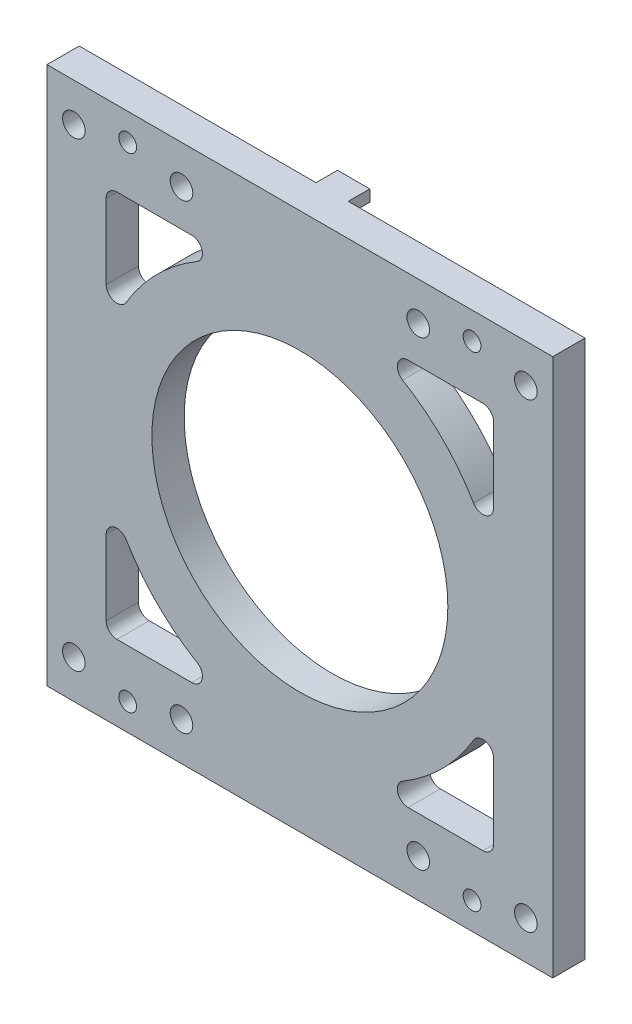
ISO-10303-21;
HEADER;
FILE_DESCRIPTION(('STEP AP214'),'2;1');
FILE_NAME('part.step','',(''),(''),'','','');
FILE_SCHEMA(('AUTOMOTIVE_DESIGN { 1 0 10303 214 1 1 1 1 }'));
ENDSEC;
DATA;
#1=APPLICATION_CONTEXT('core data for automotive mechanical design processes');
#2=APPLICATION_PROTOCOL_DEFINITION('international standard','automotive_design',2000,#1);
#3=PRODUCT_CONTEXT('',#1,'mechanical');
#4=PRODUCT('Part','Part','',(#3));
#5=PRODUCT_RELATED_PRODUCT_CATEGORY('part','',(#4));
#6=PRODUCT_DEFINITION_FORMATION('','',#4);
#7=PRODUCT_DEFINITION_CONTEXT('part definition',#1,'design');
#8=PRODUCT_DEFINITION('design','',#6,#7);
#9=PRODUCT_DEFINITION_SHAPE('','',#8);
#10=(LENGTH_UNIT() NAMED_UNIT(*) SI_UNIT(.MILLI.,.METRE.));
#11=(NAMED_UNIT(*) PLANE_ANGLE_UNIT() SI_UNIT($,.RADIAN.));
#12=(NAMED_UNIT(*) SI_UNIT($,.STERADIAN.) SOLID_ANGLE_UNIT());
#13=UNCERTAINTY_MEASURE_WITH_UNIT(LENGTH_MEASURE(1.E-05),#10,'distance_accuracy_value','');
#14=(GEOMETRIC_REPRESENTATION_CONTEXT(3) GLOBAL_UNCERTAINTY_ASSIGNED_CONTEXT((#13)) GLOBAL_UNIT_ASSIGNED_CONTEXT((#10,
#11,#12)) REPRESENTATION_CONTEXT('',''));
#15=CARTESIAN_POINT('',(0.,0.,0.));
#16=DIRECTION('',(0.,0.,1.));
#17=DIRECTION('',(1.,0.,0.));
#18=AXIS2_PLACEMENT_3D('',#15,#16,#17);
#19=CARTESIAN_POINT('',(-34.,-24.8940307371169,52.));
#20=DIRECTION('',(0.,0.,-1.));
#21=DIRECTION('',(-1.,0.,0.));
#22=AXIS2_PLACEMENT_3D('',#19,#20,#21);
#23=CYLINDRICAL_SURFACE('',#22,2.);
#24=CARTESIAN_POINT('',(-34.,-24.8940307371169,6.));
#25=DIRECTION('',(0.,0.,-1.));
#26=DIRECTION('',(1.,0.,0.));
#27=AXIS2_PLACEMENT_3D('',#24,#25,#26);
#28=CIRCLE('',#27,2.);
#29=CARTESIAN_POINT('',(-32.2784810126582,-25.9120544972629,6.));
#30=VERTEX_POINT('',#29);
#31=CARTESIAN_POINT('',(-36.,-24.8940307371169,6.));
#32=VERTEX_POINT('',#31);
#33=EDGE_CURVE('E560',#30,#32,#28,.T.);
#34=ORIENTED_EDGE('',*,*,#33,.F.);
#35=DIRECTION('',(0.,0.,1.));
#36=VECTOR('',#35,1.);
#37=CARTESIAN_POINT('',(-32.2784810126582,-25.9120544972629,52.));
#38=LINE('',#37,#36);
#39=CARTESIAN_POINT('',(-32.2784810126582,-25.9120544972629,0.));
#40=VERTEX_POINT('',#39);
#41=EDGE_CURVE('E298',#40,#30,#38,.T.);
#42=ORIENTED_EDGE('',*,*,#41,.F.);
#43=CARTESIAN_POINT('',(-34.,-24.8940307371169,0.));
#44=DIRECTION('',(0.,0.,1.));
#45=DIRECTION('',(1.,0.,0.));
#46=AXIS2_PLACEMENT_3D('',#43,#44,#45);
#47=CIRCLE('',#46,2.);
#48=CARTESIAN_POINT('',(-36.,-24.8940307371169,0.));
#49=VERTEX_POINT('',#48);
#50=EDGE_CURVE('E447',#49,#40,#47,.T.);
#51=ORIENTED_EDGE('',*,*,#50,.F.);
#52=DIRECTION('',(0.,0.,-1.));
#53=VECTOR('',#52,1.);
#54=CARTESIAN_POINT('',(-36.,-24.8940307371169,52.));
#55=LINE('',#54,#53);
#56=EDGE_CURVE('E306',#32,#49,#55,.T.);
#57=ORIENTED_EDGE('',*,*,#56,.F.);
#58=EDGE_LOOP('',(#34,#42,#51,#57));
#59=FACE_BOUND('',#58,.T.);
#60=ADVANCED_FACE('F17',(#59),#23,.F.);
#61=CARTESIAN_POINT('',(-20.1059692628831,-11.,52.));
#62=DIRECTION('',(0.,0.,-1.));
#63=DIRECTION('',(-1.,0.,0.));
#64=AXIS2_PLACEMENT_3D('',#61,#62,#63);
#65=CYLINDRICAL_SURFACE('',#64,2.);
#66=CARTESIAN_POINT('',(-20.1059692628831,-11.,6.));
#67=DIRECTION('',(0.,0.,-1.));
#68=DIRECTION('',(1.,0.,0.));
#69=AXIS2_PLACEMENT_3D('',#66,#67,#68);
#70=CIRCLE('',#69,2.);
#71=CARTESIAN_POINT('',(-20.1059692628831,-9.,6.));
#72=VERTEX_POINT('',#71);
#73=CARTESIAN_POINT('',(-19.0879455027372,-12.7215189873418,6.));
#74=VERTEX_POINT('',#73);
#75=EDGE_CURVE('E478',#72,#74,#70,.T.);
#76=ORIENTED_EDGE('',*,*,#75,.F.);
#77=DIRECTION('',(0.,0.,1.));
#78=VECTOR('',#77,1.);
#79=CARTESIAN_POINT('',(-20.1059692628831,-9.,6.));
#80=LINE('',#79,#78);
#81=CARTESIAN_POINT('',(-20.1059692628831,-9.,0.));
#82=VERTEX_POINT('',#81);
#83=EDGE_CURVE('E302',#82,#72,#80,.T.);
#84=ORIENTED_EDGE('',*,*,#83,.F.);
#85=CARTESIAN_POINT('',(-20.1059692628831,-11.,0.));
#86=DIRECTION('',(0.,0.,1.));
#87=DIRECTION('',(1.,0.,0.));
#88=AXIS2_PLACEMENT_3D('',#85,#86,#87);
#89=CIRCLE('',#88,2.);
#90=CARTESIAN_POINT('',(-19.0879455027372,-12.7215189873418,0.));
#91=VERTEX_POINT('',#90);
#92=EDGE_CURVE('E522',#91,#82,#89,.T.);
#93=ORIENTED_EDGE('',*,*,#92,.F.);
#94=DIRECTION('',(0.,0.,-1.));
#95=VECTOR('',#94,1.);
#96=CARTESIAN_POINT('',(-19.0879455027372,-12.7215189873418,52.));
#97=LINE('',#96,#95);
#98=EDGE_CURVE('E243',#74,#91,#97,.T.);
#99=ORIENTED_EDGE('',*,*,#98,.F.);
#100=EDGE_LOOP('',(#76,#84,#93,#99));
#101=FACE_BOUND('',#100,.T.);
#102=ADVANCED_FACE('F19',(#101),#65,.F.);
#103=CARTESIAN_POINT('',(-34.,-11.,52.));
#104=DIRECTION('',(0.,0.,-1.));
#105=DIRECTION('',(-1.,0.,0.));
#106=AXIS2_PLACEMENT_3D('',#103,#104,#105);
#107=CYLINDRICAL_SURFACE('',#106,2.);
#108=CARTESIAN_POINT('',(-34.,-11.,6.));
#109=DIRECTION('',(0.,0.,-1.));
#110=DIRECTION('',(1.,0.,0.));
#111=AXIS2_PLACEMENT_3D('',#108,#109,#110);
#112=CIRCLE('',#111,2.);
#113=CARTESIAN_POINT('',(-36.,-11.,6.));
#114=VERTEX_POINT('',#113);
#115=CARTESIAN_POINT('',(-34.,-9.,6.));
#116=VERTEX_POINT('',#115);
#117=EDGE_CURVE('E559',#114,#116,#112,.T.);
#118=ORIENTED_EDGE('',*,*,#117,.F.);
#119=DIRECTION('',(0.,0.,1.));
#120=VECTOR('',#119,1.);
#121=CARTESIAN_POINT('',(-36.,-11.,52.));
#122=LINE('',#121,#120);
#123=CARTESIAN_POINT('',(-36.,-11.,0.));
#124=VERTEX_POINT('',#123);
#125=EDGE_CURVE('E305',#124,#114,#122,.T.);
#126=ORIENTED_EDGE('',*,*,#125,.F.);
#127=CARTESIAN_POINT('',(-34.,-11.,0.));
#128=DIRECTION('',(0.,0.,1.));
#129=DIRECTION('',(1.,0.,0.));
#130=AXIS2_PLACEMENT_3D('',#127,#128,#129);
#131=CIRCLE('',#130,2.);
#132=CARTESIAN_POINT('',(-34.,-9.,0.));
#133=VERTEX_POINT('',#132);
#134=EDGE_CURVE('E477',#133,#124,#131,.T.);
#135=ORIENTED_EDGE('',*,*,#134,.F.);
#136=DIRECTION('',(0.,0.,-1.));
#137=VECTOR('',#136,1.);
#138=CARTESIAN_POINT('',(-34.,-9.,52.));
#139=LINE('',#138,#137);
#140=EDGE_CURVE('E301',#116,#133,#139,.T.);
#141=ORIENTED_EDGE('',*,*,#140,.F.);
#142=EDGE_LOOP('',(#118,#126,#135,#141));
#143=FACE_BOUND('',#142,.T.);
#144=ADVANCED_FACE('F858',(#143),#107,.F.);
#145=CARTESIAN_POINT('',(-34.,-65.1059692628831,52.));
#146=DIRECTION('',(0.,0.,-1.));
#147=DIRECTION('',(-1.,0.,0.));
#148=AXIS2_PLACEMENT_3D('',#145,#146,#147);
#149=CYLINDRICAL_SURFACE('',#148,2.);
#150=CARTESIAN_POINT('',(-34.,-65.1059692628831,6.));
#151=DIRECTION('',(0.,0.,-1.));
#152=DIRECTION('',(1.,0.,0.));
#153=AXIS2_PLACEMENT_3D('',#150,#151,#152);
#154=CIRCLE('',#153,2.);
#155=CARTESIAN_POINT('',(-36.,-65.1059692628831,6.));
#156=VERTEX_POINT('',#155);
#157=CARTESIAN_POINT('',(-32.2784810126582,-64.0879455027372,6.));
#158=VERTEX_POINT('',#157);
#159=EDGE_CURVE('E577',#156,#158,#154,.T.);
#160=ORIENTED_EDGE('',*,*,#159,.F.);
#161=DIRECTION('',(0.,0.,1.));
#162=VECTOR('',#161,1.);
#163=CARTESIAN_POINT('',(-36.,-65.1059692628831,52.));
#164=LINE('',#163,#162);
#165=CARTESIAN_POINT('',(-36.,-65.1059692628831,0.));
#166=VERTEX_POINT('',#165);
#167=EDGE_CURVE('E321',#166,#156,#164,.T.);
#168=ORIENTED_EDGE('',*,*,#167,.F.);
#169=CARTESIAN_POINT('',(-34.,-65.1059692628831,0.));
#170=DIRECTION('',(0.,0.,1.));
#171=DIRECTION('',(1.,0.,0.));
#172=AXIS2_PLACEMENT_3D('',#169,#170,#171);
#173=CIRCLE('',#172,2.);
#174=CARTESIAN_POINT('',(-32.2784810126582,-64.0879455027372,0.));
#175=VERTEX_POINT('',#174);
#176=EDGE_CURVE('E533',#175,#166,#173,.T.);
#177=ORIENTED_EDGE('',*,*,#176,.F.);
#178=DIRECTION('',(0.,0.,-1.));
#179=VECTOR('',#178,1.);
#180=CARTESIAN_POINT('',(-32.2784810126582,-64.0879455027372,52.));
#181=LINE('',#180,#179);
#182=EDGE_CURVE('E313',#158,#175,#181,.T.);
#183=ORIENTED_EDGE('',*,*,#182,.F.);
#184=EDGE_LOOP('',(#160,#168,#177,#183));
#185=FACE_BOUND('',#184,.T.);
#186=ADVANCED_FACE('F879',(#185),#149,.F.);
#187=CARTESIAN_POINT('',(-20.1059692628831,-79.,52.));
#188=DIRECTION('',(0.,0.,-1.));
#189=DIRECTION('',(-1.,0.,0.));
#190=AXIS2_PLACEMENT_3D('',#187,#188,#189);
#191=CYLINDRICAL_SURFACE('',#190,2.);
#192=CARTESIAN_POINT('',(-20.1059692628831,-79.,6.));
#193=DIRECTION('',(0.,0.,-1.));
#194=DIRECTION('',(1.,0.,0.));
#195=AXIS2_PLACEMENT_3D('',#192,#193,#194);
#196=CIRCLE('',#195,2.);
#197=CARTESIAN_POINT('',(-19.0879455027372,-77.2784810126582,6.));
#198=VERTEX_POINT('',#197);
#199=CARTESIAN_POINT('',(-20.1059692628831,-81.,6.));
#200=VERTEX_POINT('',#199);
#201=EDGE_CURVE('E585',#198,#200,#196,.T.);
#202=ORIENTED_EDGE('',*,*,#201,.F.);
#203=DIRECTION('',(0.,0.,1.));
#204=VECTOR('',#203,1.);
#205=CARTESIAN_POINT('',(-19.0879455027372,-77.2784810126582,52.));
#206=LINE('',#205,#204);
#207=CARTESIAN_POINT('',(-19.0879455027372,-77.2784810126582,0.));
#208=VERTEX_POINT('',#207);
#209=EDGE_CURVE('E309',#208,#198,#206,.T.);
#210=ORIENTED_EDGE('',*,*,#209,.F.);
#211=CARTESIAN_POINT('',(-20.1059692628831,-79.,0.));
#212=DIRECTION('',(0.,0.,1.));
#213=DIRECTION('',(1.,0.,0.));
#214=AXIS2_PLACEMENT_3D('',#211,#212,#213);
#215=CIRCLE('',#214,2.);
#216=CARTESIAN_POINT('',(-20.1059692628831,-81.,0.));
#217=VERTEX_POINT('',#216);
#218=EDGE_CURVE('E476',#217,#208,#215,.T.);
#219=ORIENTED_EDGE('',*,*,#218,.F.);
#220=DIRECTION('',(0.,0.,-1.));
#221=VECTOR('',#220,1.);
#222=CARTESIAN_POINT('',(-20.1059692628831,-81.,52.));
#223=LINE('',#222,#221);
#224=EDGE_CURVE('E325',#200,#217,#223,.T.);
#225=ORIENTED_EDGE('',*,*,#224,.F.);
#226=EDGE_LOOP('',(#202,#210,#219,#225));
#227=FACE_BOUND('',#226,.T.);
#228=ADVANCED_FACE('F769',(#227),#191,.F.);
#229=CARTESIAN_POINT('',(-34.,-79.,52.));
#230=DIRECTION('',(0.,0.,1.));
#231=DIRECTION('',(1.,0.,0.));
#232=AXIS2_PLACEMENT_3D('',#229,#230,#231);
#233=CYLINDRICAL_SURFACE('',#232,2.);
#234=CARTESIAN_POINT('',(-34.,-79.,6.));
#235=DIRECTION('',(0.,0.,-1.));
#236=DIRECTION('',(1.,0.,0.));
#237=AXIS2_PLACEMENT_3D('',#234,#235,#236);
#238=CIRCLE('',#237,2.);
#239=CARTESIAN_POINT('',(-34.,-81.,6.));
#240=VERTEX_POINT('',#239);
#241=CARTESIAN_POINT('',(-36.,-79.,6.));
#242=VERTEX_POINT('',#241);
#243=EDGE_CURVE('E590',#240,#242,#238,.T.);
#244=ORIENTED_EDGE('',*,*,#243,.F.);
#245=DIRECTION('',(0.,0.,1.));
#246=VECTOR('',#245,1.);
#247=CARTESIAN_POINT('',(-34.,-81.,6.));
#248=LINE('',#247,#246);
#249=CARTESIAN_POINT('',(-34.,-81.,0.));
#250=VERTEX_POINT('',#249);
#251=EDGE_CURVE('E324',#250,#240,#248,.T.);
#252=ORIENTED_EDGE('',*,*,#251,.F.);
#253=CARTESIAN_POINT('',(-34.,-79.,0.));
#254=DIRECTION('',(0.,0.,1.));
#255=DIRECTION('',(1.,0.,0.));
#256=AXIS2_PLACEMENT_3D('',#253,#254,#255);
#257=CIRCLE('',#256,2.);
#258=CARTESIAN_POINT('',(-36.,-79.,0.));
#259=VERTEX_POINT('',#258);
#260=EDGE_CURVE('E542',#259,#250,#257,.T.);
#261=ORIENTED_EDGE('',*,*,#260,.F.);
#262=DIRECTION('',(0.,0.,-1.));
#263=VECTOR('',#262,1.);
#264=CARTESIAN_POINT('',(-36.,-79.,0.));
#265=LINE('',#264,#263);
#266=EDGE_CURVE('E317',#242,#259,#265,.T.);
#267=ORIENTED_EDGE('',*,*,#266,.F.);
#268=EDGE_LOOP('',(#244,#252,#261,#267));
#269=FACE_BOUND('',#268,.T.);
#270=ADVANCED_FACE('F874',(#269),#233,.F.);
#271=CARTESIAN_POINT('',(34.,-65.1059692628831,52.));
#272=DIRECTION('',(0.,0.,-1.));
#273=DIRECTION('',(-1.,0.,0.));
#274=AXIS2_PLACEMENT_3D('',#271,#272,#273);
#275=CYLINDRICAL_SURFACE('',#274,2.);
#276=CARTESIAN_POINT('',(34.,-65.1059692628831,6.));
#277=DIRECTION('',(0.,0.,-1.));
#278=DIRECTION('',(1.,0.,0.));
#279=AXIS2_PLACEMENT_3D('',#276,#277,#278);
#280=CIRCLE('',#279,2.);
#281=CARTESIAN_POINT('',(32.2784810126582,-64.0879455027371,6.));
#282=VERTEX_POINT('',#281);
#283=CARTESIAN_POINT('',(36.,-65.1059692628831,6.));
#284=VERTEX_POINT('',#283);
#285=EDGE_CURVE('E602',#282,#284,#280,.T.);
#286=ORIENTED_EDGE('',*,*,#285,.F.);
#287=DIRECTION('',(0.,0.,1.));
#288=VECTOR('',#287,1.);
#289=CARTESIAN_POINT('',(32.2784810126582,-64.0879455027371,52.));
#290=LINE('',#289,#288);
#291=CARTESIAN_POINT('',(32.2784810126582,-64.0879455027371,0.));
#292=VERTEX_POINT('',#291);
#293=EDGE_CURVE('E329',#292,#282,#290,.T.);
#294=ORIENTED_EDGE('',*,*,#293,.F.);
#295=CARTESIAN_POINT('',(34.,-65.1059692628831,0.));
#296=DIRECTION('',(0.,0.,1.));
#297=DIRECTION('',(1.,0.,0.));
#298=AXIS2_PLACEMENT_3D('',#295,#296,#297);
#299=CIRCLE('',#298,2.);
#300=CARTESIAN_POINT('',(36.,-65.1059692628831,0.));
#301=VERTEX_POINT('',#300);
#302=EDGE_CURVE('E509',#301,#292,#299,.T.);
#303=ORIENTED_EDGE('',*,*,#302,.F.);
#304=DIRECTION('',(0.,0.,-1.));
#305=VECTOR('',#304,1.);
#306=CARTESIAN_POINT('',(36.,-65.1059692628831,0.));
#307=LINE('',#306,#305);
#308=EDGE_CURVE('E337',#284,#301,#307,.T.);
#309=ORIENTED_EDGE('',*,*,#308,.F.);
#310=EDGE_LOOP('',(#286,#294,#303,#309));
#311=FACE_BOUND('',#310,.T.);
#312=ADVANCED_FACE('F872',(#311),#275,.F.);
#313=CARTESIAN_POINT('',(34.,-79.,52.));
#314=DIRECTION('',(0.,0.,-1.));
#315=DIRECTION('',(-1.,0.,0.));
#316=AXIS2_PLACEMENT_3D('',#313,#314,#315);
#317=CYLINDRICAL_SURFACE('',#316,2.);
#318=CARTESIAN_POINT('',(34.,-79.,6.));
#319=DIRECTION('',(0.,0.,-1.));
#320=DIRECTION('',(1.,0.,0.));
#321=AXIS2_PLACEMENT_3D('',#318,#319,#320);
#322=CIRCLE('',#321,2.);
#323=CARTESIAN_POINT('',(36.,-79.,6.));
#324=VERTEX_POINT('',#323);
#325=CARTESIAN_POINT('',(34.,-81.,6.));
#326=VERTEX_POINT('',#325);
#327=EDGE_CURVE('E612',#324,#326,#322,.T.);
#328=ORIENTED_EDGE('',*,*,#327,.F.);
#329=DIRECTION('',(0.,0.,1.));
#330=VECTOR('',#329,1.);
#331=CARTESIAN_POINT('',(36.,-79.,52.));
#332=LINE('',#331,#330);
#333=CARTESIAN_POINT('',(36.,-79.,0.));
#334=VERTEX_POINT('',#333);
#335=EDGE_CURVE('E333',#334,#324,#332,.T.);
#336=ORIENTED_EDGE('',*,*,#335,.F.);
#337=CARTESIAN_POINT('',(34.,-79.,0.));
#338=DIRECTION('',(0.,0.,1.));
#339=DIRECTION('',(1.,0.,0.));
#340=AXIS2_PLACEMENT_3D('',#337,#338,#339);
#341=CIRCLE('',#340,2.);
#342=CARTESIAN_POINT('',(34.,-81.,0.));
#343=VERTEX_POINT('',#342);
#344=EDGE_CURVE('E448',#343,#334,#341,.T.);
#345=ORIENTED_EDGE('',*,*,#344,.F.);
#346=DIRECTION('',(0.,0.,-1.));
#347=VECTOR('',#346,1.);
#348=CARTESIAN_POINT('',(34.,-81.,52.));
#349=LINE('',#348,#347);
#350=EDGE_CURVE('E332',#326,#343,#349,.T.);
#351=ORIENTED_EDGE('',*,*,#350,.F.);
#352=EDGE_LOOP('',(#328,#336,#345,#351));
#353=FACE_BOUND('',#352,.T.);
#354=ADVANCED_FACE('F869',(#353),#317,.F.);
#355=CARTESIAN_POINT('',(34.,-24.8940307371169,52.));
#356=DIRECTION('',(0.,0.,-1.));
#357=DIRECTION('',(-1.,0.,0.));
#358=AXIS2_PLACEMENT_3D('',#355,#356,#357);
#359=CYLINDRICAL_SURFACE('',#358,2.);
#360=CARTESIAN_POINT('',(34.,-24.8940307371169,6.));
#361=DIRECTION('',(0.,0.,-1.));
#362=DIRECTION('',(1.,0.,0.));
#363=AXIS2_PLACEMENT_3D('',#360,#361,#362);
#364=CIRCLE('',#363,2.);
#365=CARTESIAN_POINT('',(36.,-24.8940307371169,6.));
#366=VERTEX_POINT('',#365);
#367=CARTESIAN_POINT('',(32.2784810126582,-25.9120544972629,6.));
#368=VERTEX_POINT('',#367);
#369=EDGE_CURVE('E368',#366,#368,#364,.T.);
#370=ORIENTED_EDGE('',*,*,#369,.F.);
#371=DIRECTION('',(0.,0.,1.));
#372=VECTOR('',#371,1.);
#373=CARTESIAN_POINT('',(36.,-24.8940307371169,6.));
#374=LINE('',#373,#372);
#375=CARTESIAN_POINT('',(36.,-24.8940307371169,0.));
#376=VERTEX_POINT('',#375);
#377=EDGE_CURVE('E27',#376,#366,#374,.T.);
#378=ORIENTED_EDGE('',*,*,#377,.F.);
#379=CARTESIAN_POINT('',(34.,-24.8940307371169,0.));
#380=DIRECTION('',(0.,0.,1.));
#381=DIRECTION('',(1.,0.,0.));
#382=AXIS2_PLACEMENT_3D('',#379,#380,#381);
#383=CIRCLE('',#382,2.);
#384=CARTESIAN_POINT('',(32.2784810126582,-25.9120544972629,0.));
#385=VERTEX_POINT('',#384);
#386=EDGE_CURVE('E531',#385,#376,#383,.T.);
#387=ORIENTED_EDGE('',*,*,#386,.F.);
#388=DIRECTION('',(0.,0.,-1.));
#389=VECTOR('',#388,1.);
#390=CARTESIAN_POINT('',(32.2784810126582,-25.9120544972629,52.));
#391=LINE('',#390,#389);
#392=EDGE_CURVE('E345',#368,#385,#391,.T.);
#393=ORIENTED_EDGE('',*,*,#392,.F.);
#394=EDGE_LOOP('',(#370,#378,#387,#393));
#395=FACE_BOUND('',#394,.T.);
#396=ADVANCED_FACE('F369',(#395),#359,.F.);
#397=CARTESIAN_POINT('',(34.,-11.,52.));
#398=DIRECTION('',(0.,0.,1.));
#399=DIRECTION('',(1.,0.,0.));
#400=AXIS2_PLACEMENT_3D('',#397,#398,#399);
#401=CYLINDRICAL_SURFACE('',#400,2.);
#402=CARTESIAN_POINT('',(34.,-11.,6.));
#403=DIRECTION('',(0.,0.,-1.));
#404=DIRECTION('',(1.,0.,0.));
#405=AXIS2_PLACEMENT_3D('',#402,#403,#404);
#406=CIRCLE('',#405,2.);
#407=CARTESIAN_POINT('',(34.,-9.,6.));
#408=VERTEX_POINT('',#407);
#409=CARTESIAN_POINT('',(36.,-11.,6.));
#410=VERTEX_POINT('',#409);
#411=EDGE_CURVE('E380',#408,#410,#406,.T.);
#412=ORIENTED_EDGE('',*,*,#411,.F.);
#413=DIRECTION('',(0.,0.,1.));
#414=VECTOR('',#413,1.);
#415=CARTESIAN_POINT('',(34.,-9.,6.));
#416=LINE('',#415,#414);
#417=CARTESIAN_POINT('',(34.,-9.,0.));
#418=VERTEX_POINT('',#417);
#419=EDGE_CURVE('E11',#418,#408,#416,.T.);
#420=ORIENTED_EDGE('',*,*,#419,.F.);
#421=CARTESIAN_POINT('',(34.,-11.,0.));
#422=DIRECTION('',(0.,0.,1.));
#423=DIRECTION('',(1.,0.,0.));
#424=AXIS2_PLACEMENT_3D('',#421,#422,#423);
#425=CIRCLE('',#424,2.);
#426=CARTESIAN_POINT('',(36.,-11.,0.));
#427=VERTEX_POINT('',#426);
#428=EDGE_CURVE('E467',#427,#418,#425,.T.);
#429=ORIENTED_EDGE('',*,*,#428,.F.);
#430=DIRECTION('',(0.,0.,-1.));
#431=VECTOR('',#430,1.);
#432=CARTESIAN_POINT('',(36.,-11.,0.));
#433=LINE('',#432,#431);
#434=EDGE_CURVE('E346',#410,#427,#433,.T.);
#435=ORIENTED_EDGE('',*,*,#434,.F.);
#436=EDGE_LOOP('',(#412,#420,#429,#435));
#437=FACE_BOUND('',#436,.T.);
#438=ADVANCED_FACE('F831',(#437),#401,.F.);
#439=CARTESIAN_POINT('',(0.,-9.,52.));
#440=DIRECTION('',(0.,-1.,0.));
#441=DIRECTION('',(0.,0.,-1.));
#442=AXIS2_PLACEMENT_3D('',#439,#440,#441);
#443=PLANE('',#442);
#444=DIRECTION('',(-1.,0.,0.));
#445=VECTOR('',#444,1.);
#446=CARTESIAN_POINT('',(0.,-9.,0.));
#447=LINE('',#446,#445);
#448=CARTESIAN_POINT('',(20.1059692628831,-9.,0.));
#449=VERTEX_POINT('',#448);
#450=EDGE_CURVE('E532',#418,#449,#447,.T.);
#451=ORIENTED_EDGE('',*,*,#450,.F.);
#452=ORIENTED_EDGE('',*,*,#419,.T.);
#453=DIRECTION('',(1.,0.,0.));
#454=VECTOR('',#453,1.);
#455=CARTESIAN_POINT('',(0.,-9.,6.));
#456=LINE('',#455,#454);
#457=CARTESIAN_POINT('',(20.1059692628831,-9.,6.));
#458=VERTEX_POINT('',#457);
#459=EDGE_CURVE('E386',#458,#408,#456,.T.);
#460=ORIENTED_EDGE('',*,*,#459,.F.);
#461=DIRECTION('',(0.,0.,-1.));
#462=VECTOR('',#461,1.);
#463=CARTESIAN_POINT('',(20.1059692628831,-9.,0.));
#464=LINE('',#463,#462);
#465=EDGE_CURVE('E628',#458,#449,#464,.T.);
#466=ORIENTED_EDGE('',*,*,#465,.T.);
#467=EDGE_LOOP('',(#451,#452,#460,#466));
#468=FACE_BOUND('',#467,.T.);
#469=ADVANCED_FACE('F626',(#468),#443,.T.);
#470=CARTESIAN_POINT('',(36.,0.,52.));
#471=DIRECTION('',(-1.,0.,0.));
#472=DIRECTION('',(0.,0.,1.));
#473=AXIS2_PLACEMENT_3D('',#470,#471,#472);
#474=PLANE('',#473);
#475=DIRECTION('',(0.,-1.,0.));
#476=VECTOR('',#475,1.);
#477=CARTESIAN_POINT('',(36.,0.,6.));
#478=LINE('',#477,#476);
#479=EDGE_CURVE('E358',#410,#366,#478,.T.);
#480=ORIENTED_EDGE('',*,*,#479,.F.);
#481=ORIENTED_EDGE('',*,*,#434,.T.);
#482=DIRECTION('',(0.,1.,0.));
#483=VECTOR('',#482,1.);
#484=CARTESIAN_POINT('',(36.,0.,0.));
#485=LINE('',#484,#483);
#486=EDGE_CURVE('E361',#376,#427,#485,.T.);
#487=ORIENTED_EDGE('',*,*,#486,.F.);
#488=ORIENTED_EDGE('',*,*,#377,.T.);
#489=EDGE_LOOP('',(#480,#481,#487,#488));
#490=FACE_BOUND('',#489,.T.);
#491=ADVANCED_FACE('F356',(#490),#474,.T.);
#492=CARTESIAN_POINT('',(0.,-45.,52.));
#493=DIRECTION('',(0.,0.,-1.));
#494=DIRECTION('',(-1.,0.,0.));
#495=AXIS2_PLACEMENT_3D('',#492,#493,#494);
#496=CYLINDRICAL_SURFACE('',#495,37.5);
#497=CARTESIAN_POINT('',(0.,-45.,0.));
#498=DIRECTION('',(0.,0.,-1.));
#499=DIRECTION('',(-1.,0.,0.));
#500=AXIS2_PLACEMENT_3D('',#497,#498,#499);
#501=CIRCLE('',#500,37.5);
#502=CARTESIAN_POINT('',(19.0879455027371,-12.7215189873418,0.));
#503=VERTEX_POINT('',#502);
#504=EDGE_CURVE('E527',#503,#385,#501,.T.);
#505=ORIENTED_EDGE('',*,*,#504,.F.);
#506=DIRECTION('',(0.,0.,1.));
#507=VECTOR('',#506,1.);
#508=CARTESIAN_POINT('',(19.0879455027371,-12.7215189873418,52.));
#509=LINE('',#508,#507);
#510=CARTESIAN_POINT('',(19.0879455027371,-12.7215189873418,6.));
#511=VERTEX_POINT('',#510);
#512=EDGE_CURVE('E341',#503,#511,#509,.T.);
#513=ORIENTED_EDGE('',*,*,#512,.T.);
#514=CARTESIAN_POINT('',(0.,-45.,6.));
#515=DIRECTION('',(0.,0.,1.));
#516=DIRECTION('',(1.,0.,0.));
#517=AXIS2_PLACEMENT_3D('',#514,#515,#516);
#518=CIRCLE('',#517,37.5);
#519=EDGE_CURVE('E374',#368,#511,#518,.T.);
#520=ORIENTED_EDGE('',*,*,#519,.F.);
#521=ORIENTED_EDGE('',*,*,#392,.T.);
#522=EDGE_LOOP('',(#505,#513,#520,#521));
#523=FACE_BOUND('',#522,.T.);
#524=ADVANCED_FACE('F837',(#523),#496,.T.);
#525=CARTESIAN_POINT('',(36.,0.,52.));
#526=DIRECTION('',(-1.,0.,0.));
#527=DIRECTION('',(0.,0.,1.));
#528=AXIS2_PLACEMENT_3D('',#525,#526,#527);
#529=PLANE('',#528);
#530=DIRECTION('',(0.,1.,0.));
#531=VECTOR('',#530,1.);
#532=CARTESIAN_POINT('',(36.,0.,0.));
#533=LINE('',#532,#531);
#534=EDGE_CURVE('E505',#334,#301,#533,.T.);
#535=ORIENTED_EDGE('',*,*,#534,.F.);
#536=ORIENTED_EDGE('',*,*,#335,.T.);
#537=DIRECTION('',(0.,-1.,0.));
#538=VECTOR('',#537,1.);
#539=CARTESIAN_POINT('',(36.,0.,6.));
#540=LINE('',#539,#538);
#541=EDGE_CURVE('E608',#284,#324,#540,.T.);
#542=ORIENTED_EDGE('',*,*,#541,.F.);
#543=ORIENTED_EDGE('',*,*,#308,.T.);
#544=EDGE_LOOP('',(#535,#536,#542,#543));
#545=FACE_BOUND('',#544,.T.);
#546=ADVANCED_FACE('F839',(#545),#529,.T.);
#547=CARTESIAN_POINT('',(0.,-81.,52.));
#548=DIRECTION('',(0.,-1.,0.));
#549=DIRECTION('',(0.,0.,-1.));
#550=AXIS2_PLACEMENT_3D('',#547,#548,#549);
#551=PLANE('',#550);
#552=DIRECTION('',(1.,0.,0.));
#553=VECTOR('',#552,1.);
#554=CARTESIAN_POINT('',(0.,-81.,6.));
#555=LINE('',#554,#553);
#556=CARTESIAN_POINT('',(20.1059692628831,-81.,6.));
#557=VERTEX_POINT('',#556);
#558=EDGE_CURVE('E594',#557,#326,#555,.T.);
#559=ORIENTED_EDGE('',*,*,#558,.T.);
#560=ORIENTED_EDGE('',*,*,#350,.T.);
#561=DIRECTION('',(-1.,0.,0.));
#562=VECTOR('',#561,1.);
#563=CARTESIAN_POINT('',(0.,-81.,0.));
#564=LINE('',#563,#562);
#565=CARTESIAN_POINT('',(20.1059692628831,-81.,0.));
#566=VERTEX_POINT('',#565);
#567=EDGE_CURVE('E514',#343,#566,#564,.T.);
#568=ORIENTED_EDGE('',*,*,#567,.T.);
#569=DIRECTION('',(0.,0.,1.));
#570=VECTOR('',#569,1.);
#571=CARTESIAN_POINT('',(20.1059692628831,-81.,52.));
#572=LINE('',#571,#570);
#573=EDGE_CURVE('E338',#566,#557,#572,.T.);
#574=ORIENTED_EDGE('',*,*,#573,.T.);
#575=EDGE_LOOP('',(#559,#560,#568,#574));
#576=FACE_BOUND('',#575,.T.);
#577=ADVANCED_FACE('F846',(#576),#551,.F.);
#578=CARTESIAN_POINT('',(0.,-45.,52.));
#579=DIRECTION('',(0.,0.,-1.));
#580=DIRECTION('',(-1.,0.,0.));
#581=AXIS2_PLACEMENT_3D('',#578,#579,#580);
#582=CYLINDRICAL_SURFACE('',#581,37.5);
#583=CARTESIAN_POINT('',(0.,-45.,0.));
#584=DIRECTION('',(0.,0.,-1.));
#585=DIRECTION('',(-1.,0.,0.));
#586=AXIS2_PLACEMENT_3D('',#583,#584,#585);
#587=CIRCLE('',#586,37.5);
#588=CARTESIAN_POINT('',(19.0879455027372,-77.2784810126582,0.));
#589=VERTEX_POINT('',#588);
#590=EDGE_CURVE('E510',#292,#589,#587,.T.);
#591=ORIENTED_EDGE('',*,*,#590,.F.);
#592=ORIENTED_EDGE('',*,*,#293,.T.);
#593=CARTESIAN_POINT('',(0.,-45.,6.));
#594=DIRECTION('',(0.,0.,1.));
#595=DIRECTION('',(1.,0.,0.));
#596=AXIS2_PLACEMENT_3D('',#593,#594,#595);
#597=CIRCLE('',#596,37.5);
#598=CARTESIAN_POINT('',(19.0879455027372,-77.2784810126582,6.));
#599=VERTEX_POINT('',#598);
#600=EDGE_CURVE('E598',#599,#282,#597,.T.);
#601=ORIENTED_EDGE('',*,*,#600,.F.);
#602=DIRECTION('',(0.,0.,-1.));
#603=VECTOR('',#602,1.);
#604=CARTESIAN_POINT('',(19.0879455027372,-77.2784810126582,52.));
#605=LINE('',#604,#603);
#606=EDGE_CURVE('E908',#599,#589,#605,.T.);
#607=ORIENTED_EDGE('',*,*,#606,.T.);
#608=EDGE_LOOP('',(#591,#592,#601,#607));
#609=FACE_BOUND('',#608,.T.);
#610=ADVANCED_FACE('F941',(#609),#582,.T.);
#611=CARTESIAN_POINT('',(0.,-81.,52.));
#612=DIRECTION('',(0.,-1.,0.));
#613=DIRECTION('',(0.,0.,-1.));
#614=AXIS2_PLACEMENT_3D('',#611,#612,#613);
#615=PLANE('',#614);
#616=DIRECTION('',(-1.,0.,0.));
#617=VECTOR('',#616,1.);
#618=CARTESIAN_POINT('',(0.,-81.,0.));
#619=LINE('',#618,#617);
#620=EDGE_CURVE('E472',#217,#250,#619,.T.);
#621=ORIENTED_EDGE('',*,*,#620,.T.);
#622=ORIENTED_EDGE('',*,*,#251,.T.);
#623=DIRECTION('',(1.,0.,0.));
#624=VECTOR('',#623,1.);
#625=CARTESIAN_POINT('',(0.,-81.,6.));
#626=LINE('',#625,#624);
#627=EDGE_CURVE('E586',#240,#200,#626,.T.);
#628=ORIENTED_EDGE('',*,*,#627,.T.);
#629=ORIENTED_EDGE('',*,*,#224,.T.);
#630=EDGE_LOOP('',(#621,#622,#628,#629));
#631=FACE_BOUND('',#630,.T.);
#632=ADVANCED_FACE('F1058',(#631),#615,.F.);
#633=CARTESIAN_POINT('',(-36.,0.,52.));
#634=DIRECTION('',(-1.,0.,0.));
#635=DIRECTION('',(0.,0.,1.));
#636=AXIS2_PLACEMENT_3D('',#633,#634,#635);
#637=PLANE('',#636);
#638=DIRECTION('',(0.,-1.,0.));
#639=VECTOR('',#638,1.);
#640=CARTESIAN_POINT('',(-36.,0.,6.));
#641=LINE('',#640,#639);
#642=EDGE_CURVE('E564',#156,#242,#641,.T.);
#643=ORIENTED_EDGE('',*,*,#642,.T.);
#644=ORIENTED_EDGE('',*,*,#266,.T.);
#645=DIRECTION('',(0.,1.,0.));
#646=VECTOR('',#645,1.);
#647=CARTESIAN_POINT('',(-36.,0.,0.));
#648=LINE('',#647,#646);
#649=EDGE_CURVE('E537',#259,#166,#648,.T.);
#650=ORIENTED_EDGE('',*,*,#649,.T.);
#651=ORIENTED_EDGE('',*,*,#167,.T.);
#652=EDGE_LOOP('',(#643,#644,#650,#651));
#653=FACE_BOUND('',#652,.T.);
#654=ADVANCED_FACE('F891',(#653),#637,.F.);
#655=CARTESIAN_POINT('',(0.,-45.,52.));
#656=DIRECTION('',(0.,0.,-1.));
#657=DIRECTION('',(-1.,0.,0.));
#658=AXIS2_PLACEMENT_3D('',#655,#656,#657);
#659=CYLINDRICAL_SURFACE('',#658,37.5);
#660=CARTESIAN_POINT('',(0.,-45.,0.));
#661=DIRECTION('',(0.,0.,-1.));
#662=DIRECTION('',(-1.,0.,0.));
#663=AXIS2_PLACEMENT_3D('',#660,#661,#662);
#664=CIRCLE('',#663,37.5);
#665=EDGE_CURVE('E538',#208,#175,#664,.T.);
#666=ORIENTED_EDGE('',*,*,#665,.F.);
#667=ORIENTED_EDGE('',*,*,#209,.T.);
#668=CARTESIAN_POINT('',(0.,-45.,6.));
#669=DIRECTION('',(0.,0.,1.));
#670=DIRECTION('',(1.,0.,0.));
#671=AXIS2_PLACEMENT_3D('',#668,#669,#670);
#672=CIRCLE('',#671,37.5);
#673=EDGE_CURVE('E581',#158,#198,#672,.T.);
#674=ORIENTED_EDGE('',*,*,#673,.F.);
#675=ORIENTED_EDGE('',*,*,#182,.T.);
#676=EDGE_LOOP('',(#666,#667,#674,#675));
#677=FACE_BOUND('',#676,.T.);
#678=ADVANCED_FACE('F1054',(#677),#659,.T.);
#679=CARTESIAN_POINT('',(-36.,0.,52.));
#680=DIRECTION('',(-1.,0.,0.));
#681=DIRECTION('',(0.,0.,1.));
#682=AXIS2_PLACEMENT_3D('',#679,#680,#681);
#683=PLANE('',#682);
#684=DIRECTION('',(0.,1.,0.));
#685=VECTOR('',#684,1.);
#686=CARTESIAN_POINT('',(-36.,0.,0.));
#687=LINE('',#686,#685);
#688=EDGE_CURVE('E443',#49,#124,#687,.T.);
#689=ORIENTED_EDGE('',*,*,#688,.T.);
#690=ORIENTED_EDGE('',*,*,#125,.T.);
#691=DIRECTION('',(0.,-1.,0.));
#692=VECTOR('',#691,1.);
#693=CARTESIAN_POINT('',(-36.,0.,6.));
#694=LINE('',#693,#692);
#695=EDGE_CURVE('E555',#114,#32,#694,.T.);
#696=ORIENTED_EDGE('',*,*,#695,.T.);
#697=ORIENTED_EDGE('',*,*,#56,.T.);
#698=EDGE_LOOP('',(#689,#690,#696,#697));
#699=FACE_BOUND('',#698,.T.);
#700=ADVANCED_FACE('F1051',(#699),#683,.F.);
#701=CARTESIAN_POINT('',(0.,-9.,52.));
#702=DIRECTION('',(0.,-1.,0.));
#703=DIRECTION('',(0.,0.,-1.));
#704=AXIS2_PLACEMENT_3D('',#701,#702,#703);
#705=PLANE('',#704);
#706=DIRECTION('',(1.,0.,0.));
#707=VECTOR('',#706,1.);
#708=CARTESIAN_POINT('',(0.,-9.,6.));
#709=LINE('',#708,#707);
#710=EDGE_CURVE('E483',#116,#72,#709,.T.);
#711=ORIENTED_EDGE('',*,*,#710,.F.);
#712=ORIENTED_EDGE('',*,*,#140,.T.);
#713=DIRECTION('',(-1.,0.,0.));
#714=VECTOR('',#713,1.);
#715=CARTESIAN_POINT('',(0.,-9.,0.));
#716=LINE('',#715,#714);
#717=EDGE_CURVE('E526',#82,#133,#716,.T.);
#718=ORIENTED_EDGE('',*,*,#717,.F.);
#719=ORIENTED_EDGE('',*,*,#83,.T.);
#720=EDGE_LOOP('',(#711,#712,#718,#719));
#721=FACE_BOUND('',#720,.T.);
#722=ADVANCED_FACE('F1041',(#721),#705,.T.);
#723=CARTESIAN_POINT('',(0.,-45.,52.));
#724=DIRECTION('',(0.,0.,-1.));
#725=DIRECTION('',(-1.,0.,0.));
#726=AXIS2_PLACEMENT_3D('',#723,#724,#725);
#727=CYLINDRICAL_SURFACE('',#726,37.5);
#728=CARTESIAN_POINT('',(0.,-45.,6.));
#729=DIRECTION('',(0.,0.,1.));
#730=DIRECTION('',(1.,0.,0.));
#731=AXIS2_PLACEMENT_3D('',#728,#729,#730);
#732=CIRCLE('',#731,37.5);
#733=EDGE_CURVE('E482',#74,#30,#732,.T.);
#734=ORIENTED_EDGE('',*,*,#733,.F.);
#735=ORIENTED_EDGE('',*,*,#98,.T.);
#736=CARTESIAN_POINT('',(0.,-45.,0.));
#737=DIRECTION('',(0.,0.,-1.));
#738=DIRECTION('',(-1.,0.,0.));
#739=AXIS2_PLACEMENT_3D('',#736,#737,#738);
#740=CIRCLE('',#739,37.5);
#741=EDGE_CURVE('E518',#40,#91,#740,.T.);
#742=ORIENTED_EDGE('',*,*,#741,.F.);
#743=ORIENTED_EDGE('',*,*,#41,.T.);
#744=EDGE_LOOP('',(#734,#735,#742,#743));
#745=FACE_BOUND('',#744,.T.);
#746=ADVANCED_FACE('F1038',(#745),#727,.T.);
#747=CARTESIAN_POINT('',(0.,0.,-4.));
#748=DIRECTION('',(0.,0.,-1.));
#749=DIRECTION('',(0.,-1.,0.));
#750=AXIS2_PLACEMENT_3D('',#747,#748,#749);
#751=PLANE('',#750);
#752=DIRECTION('',(-1.,0.,0.));
#753=VECTOR('',#752,1.);
#754=CARTESIAN_POINT('',(3.,-95.,-4.));
#755=LINE('',#754,#753);
#756=CARTESIAN_POINT('',(3.,-95.,-4.));
#757=VERTEX_POINT('',#756);
#758=CARTESIAN_POINT('',(-3.,-95.,-4.));
#759=VERTEX_POINT('',#758);
#760=EDGE_CURVE('E238',#757,#759,#755,.T.);
#761=ORIENTED_EDGE('',*,*,#760,.T.);
#762=DIRECTION('',(0.,1.,0.));
#763=VECTOR('',#762,1.);
#764=CARTESIAN_POINT('',(-3.,-95.,-4.));
#765=LINE('',#764,#763);
#766=CARTESIAN_POINT('',(-3.,-92.85,-4.));
#767=VERTEX_POINT('',#766);
#768=EDGE_CURVE('E288',#759,#767,#765,.T.);
#769=ORIENTED_EDGE('',*,*,#768,.T.);
#770=DIRECTION('',(1.,0.,0.));
#771=VECTOR('',#770,1.);
#772=CARTESIAN_POINT('',(3.,-92.85,-4.));
#773=LINE('',#772,#771);
#774=CARTESIAN_POINT('',(3.,-92.85,-4.));
#775=VERTEX_POINT('',#774);
#776=EDGE_CURVE('E240',#767,#775,#773,.T.);
#777=ORIENTED_EDGE('',*,*,#776,.T.);
#778=DIRECTION('',(0.,-1.,0.));
#779=VECTOR('',#778,1.);
#780=CARTESIAN_POINT('',(3.,-95.,-4.));
#781=LINE('',#780,#779);
#782=EDGE_CURVE('E40',#775,#757,#781,.T.);
#783=ORIENTED_EDGE('',*,*,#782,.T.);
#784=EDGE_LOOP('',(#761,#769,#777,#783));
#785=FACE_BOUND('',#784,.T.);
#786=ADVANCED_FACE('F235',(#785),#751,.T.);
#787=CARTESIAN_POINT('',(3.,-95.,-4.));
#788=DIRECTION('',(-1.,0.,0.));
#789=DIRECTION('',(0.,1.,0.));
#790=AXIS2_PLACEMENT_3D('',#787,#788,#789);
#791=PLANE('',#790);
#792=DIRECTION('',(0.,-1.,0.));
#793=VECTOR('',#792,1.);
#794=CARTESIAN_POINT('',(3.,-95.,0.));
#795=LINE('',#794,#793);
#796=CARTESIAN_POINT('',(3.,-92.85,0.));
#797=VERTEX_POINT('',#796);
#798=CARTESIAN_POINT('',(3.,-95.,0.));
#799=VERTEX_POINT('',#798);
#800=EDGE_CURVE('E249',#797,#799,#795,.T.);
#801=ORIENTED_EDGE('',*,*,#800,.T.);
#802=DIRECTION('',(0.,0.,1.));
#803=VECTOR('',#802,1.);
#804=CARTESIAN_POINT('',(3.,-95.,-4.));
#805=LINE('',#804,#803);
#806=EDGE_CURVE('E246',#757,#799,#805,.T.);
#807=ORIENTED_EDGE('',*,*,#806,.F.);
#808=ORIENTED_EDGE('',*,*,#782,.F.);
#809=DIRECTION('',(0.,0.,1.));
#810=VECTOR('',#809,1.);
#811=CARTESIAN_POINT('',(3.,-92.85,-4.));
#812=LINE('',#811,#810);
#813=EDGE_CURVE('E291',#775,#797,#812,.T.);
#814=ORIENTED_EDGE('',*,*,#813,.T.);
#815=EDGE_LOOP('',(#801,#807,#808,#814));
#816=FACE_BOUND('',#815,.T.);
#817=ADVANCED_FACE('F247',(#816),#791,.F.);
#818=CARTESIAN_POINT('',(3.,-92.85,-4.));
#819=DIRECTION('',(0.,-1.,0.));
#820=DIRECTION('',(0.,0.,-1.));
#821=AXIS2_PLACEMENT_3D('',#818,#819,#820);
#822=PLANE('',#821);
#823=DIRECTION('',(1.,0.,0.));
#824=VECTOR('',#823,1.);
#825=CARTESIAN_POINT('',(3.,-92.85,0.));
#826=LINE('',#825,#824);
#827=CARTESIAN_POINT('',(-3.,-92.85,0.));
#828=VERTEX_POINT('',#827);
#829=EDGE_CURVE('E501',#828,#797,#826,.T.);
#830=ORIENTED_EDGE('',*,*,#829,.T.);
#831=ORIENTED_EDGE('',*,*,#813,.F.);
#832=ORIENTED_EDGE('',*,*,#776,.F.);
#833=DIRECTION('',(0.,0.,1.));
#834=VECTOR('',#833,1.);
#835=CARTESIAN_POINT('',(-3.,-92.85,-4.));
#836=LINE('',#835,#834);
#837=EDGE_CURVE('E285',#767,#828,#836,.T.);
#838=ORIENTED_EDGE('',*,*,#837,.T.);
#839=EDGE_LOOP('',(#830,#831,#832,#838));
#840=FACE_BOUND('',#839,.T.);
#841=ADVANCED_FACE('F1013',(#840),#822,.F.);
#842=CARTESIAN_POINT('',(-3.,-95.,-4.));
#843=DIRECTION('',(1.,0.,0.));
#844=DIRECTION('',(0.,1.,0.));
#845=AXIS2_PLACEMENT_3D('',#842,#843,#844);
#846=PLANE('',#845);
#847=DIRECTION('',(0.,1.,0.));
#848=VECTOR('',#847,1.);
#849=CARTESIAN_POINT('',(-3.,-95.,0.));
#850=LINE('',#849,#848);
#851=CARTESIAN_POINT('',(-3.,-95.,0.));
#852=VERTEX_POINT('',#851);
#853=EDGE_CURVE('E661',#852,#828,#850,.T.);
#854=ORIENTED_EDGE('',*,*,#853,.T.);
#855=ORIENTED_EDGE('',*,*,#837,.F.);
#856=ORIENTED_EDGE('',*,*,#768,.F.);
#857=DIRECTION('',(0.,0.,1.));
#858=VECTOR('',#857,1.);
#859=CARTESIAN_POINT('',(-3.,-95.,-4.));
#860=LINE('',#859,#858);
#861=EDGE_CURVE('E259',#759,#852,#860,.T.);
#862=ORIENTED_EDGE('',*,*,#861,.T.);
#863=EDGE_LOOP('',(#854,#855,#856,#862));
#864=FACE_BOUND('',#863,.T.);
#865=ADVANCED_FACE('F1011',(#864),#846,.F.);
#866=CARTESIAN_POINT('',(0.,0.,-4.));
#867=DIRECTION('',(0.,0.,-1.));
#868=DIRECTION('',(0.,-1.,0.));
#869=AXIS2_PLACEMENT_3D('',#866,#867,#868);
#870=PLANE('',#869);
#871=DIRECTION('',(0.,-1.,0.));
#872=VECTOR('',#871,1.);
#873=CARTESIAN_POINT('',(3.,5.,-4.));
#874=LINE('',#873,#872);
#875=CARTESIAN_POINT('',(3.,5.,-4.));
#876=VERTEX_POINT('',#875);
#877=CARTESIAN_POINT('',(3.,2.85,-4.));
#878=VERTEX_POINT('',#877);
#879=EDGE_CURVE('E272',#876,#878,#874,.T.);
#880=ORIENTED_EDGE('',*,*,#879,.T.);
#881=DIRECTION('',(-1.,0.,0.));
#882=VECTOR('',#881,1.);
#883=CARTESIAN_POINT('',(3.,2.85,-4.));
#884=LINE('',#883,#882);
#885=CARTESIAN_POINT('',(-3.,2.85,-4.));
#886=VERTEX_POINT('',#885);
#887=EDGE_CURVE('E277',#878,#886,#884,.T.);
#888=ORIENTED_EDGE('',*,*,#887,.T.);
#889=DIRECTION('',(0.,1.,0.));
#890=VECTOR('',#889,1.);
#891=CARTESIAN_POINT('',(-3.,5.,-4.));
#892=LINE('',#891,#890);
#893=CARTESIAN_POINT('',(-3.,5.,-4.));
#894=VERTEX_POINT('',#893);
#895=EDGE_CURVE('E281',#886,#894,#892,.T.);
#896=ORIENTED_EDGE('',*,*,#895,.T.);
#897=DIRECTION('',(1.,0.,0.));
#898=VECTOR('',#897,1.);
#899=CARTESIAN_POINT('',(3.,5.,-4.));
#900=LINE('',#899,#898);
#901=EDGE_CURVE('E400',#894,#876,#900,.T.);
#902=ORIENTED_EDGE('',*,*,#901,.T.);
#903=EDGE_LOOP('',(#880,#888,#896,#902));
#904=FACE_BOUND('',#903,.T.);
#905=ADVANCED_FACE('F1022',(#904),#870,.T.);
#906=CARTESIAN_POINT('',(-3.,5.,-4.));
#907=DIRECTION('',(1.,0.,0.));
#908=DIRECTION('',(0.,1.,0.));
#909=AXIS2_PLACEMENT_3D('',#906,#907,#908);
#910=PLANE('',#909);
#911=DIRECTION('',(0.,1.,0.));
#912=VECTOR('',#911,1.);
#913=CARTESIAN_POINT('',(-3.,5.,0.));
#914=LINE('',#913,#912);
#915=CARTESIAN_POINT('',(-3.,2.85,0.));
#916=VERTEX_POINT('',#915);
#917=CARTESIAN_POINT('',(-3.,5.,0.));
#918=VERTEX_POINT('',#917);
#919=EDGE_CURVE('E487',#916,#918,#914,.T.);
#920=ORIENTED_EDGE('',*,*,#919,.T.);
#921=DIRECTION('',(0.,0.,1.));
#922=VECTOR('',#921,1.);
#923=CARTESIAN_POINT('',(-3.,5.,-4.));
#924=LINE('',#923,#922);
#925=EDGE_CURVE('E404',#894,#918,#924,.T.);
#926=ORIENTED_EDGE('',*,*,#925,.F.);
#927=ORIENTED_EDGE('',*,*,#895,.F.);
#928=DIRECTION('',(0.,0.,1.));
#929=VECTOR('',#928,1.);
#930=CARTESIAN_POINT('',(-3.,2.85,-4.));
#931=LINE('',#930,#929);
#932=EDGE_CURVE('E276',#886,#916,#931,.T.);
#933=ORIENTED_EDGE('',*,*,#932,.T.);
#934=EDGE_LOOP('',(#920,#926,#927,#933));
#935=FACE_BOUND('',#934,.T.);
#936=ADVANCED_FACE('F1025',(#935),#910,.F.);
#937=CARTESIAN_POINT('',(3.,2.85,-4.));
#938=DIRECTION('',(0.,1.,0.));
#939=DIRECTION('',(1.,0.,0.));
#940=AXIS2_PLACEMENT_3D('',#937,#938,#939);
#941=PLANE('',#940);
#942=DIRECTION('',(-1.,0.,0.));
#943=VECTOR('',#942,1.);
#944=CARTESIAN_POINT('',(3.,2.85,0.));
#945=LINE('',#944,#943);
#946=CARTESIAN_POINT('',(3.,2.85,0.));
#947=VERTEX_POINT('',#946);
#948=EDGE_CURVE('E489',#947,#916,#945,.T.);
#949=ORIENTED_EDGE('',*,*,#948,.T.);
#950=ORIENTED_EDGE('',*,*,#932,.F.);
#951=ORIENTED_EDGE('',*,*,#887,.F.);
#952=DIRECTION('',(0.,0.,1.));
#953=VECTOR('',#952,1.);
#954=CARTESIAN_POINT('',(3.,2.85,-4.));
#955=LINE('',#954,#953);
#956=EDGE_CURVE('E254',#878,#947,#955,.T.);
#957=ORIENTED_EDGE('',*,*,#956,.T.);
#958=EDGE_LOOP('',(#949,#950,#951,#957));
#959=FACE_BOUND('',#958,.T.);
#960=ADVANCED_FACE('F1027',(#959),#941,.F.);
#961=CARTESIAN_POINT('',(3.,5.,-4.));
#962=DIRECTION('',(-1.,0.,0.));
#963=DIRECTION('',(0.,0.,1.));
#964=AXIS2_PLACEMENT_3D('',#961,#962,#963);
#965=PLANE('',#964);
#966=DIRECTION('',(0.,-1.,0.));
#967=VECTOR('',#966,1.);
#968=CARTESIAN_POINT('',(3.,5.,0.));
#969=LINE('',#968,#967);
#970=CARTESIAN_POINT('',(3.,5.,0.));
#971=VERTEX_POINT('',#970);
#972=EDGE_CURVE('E423',#971,#947,#969,.T.);
#973=ORIENTED_EDGE('',*,*,#972,.T.);
#974=ORIENTED_EDGE('',*,*,#956,.F.);
#975=ORIENTED_EDGE('',*,*,#879,.F.);
#976=DIRECTION('',(0.,0.,1.));
#977=VECTOR('',#976,1.);
#978=CARTESIAN_POINT('',(3.,5.,-4.));
#979=LINE('',#978,#977);
#980=EDGE_CURVE('E395',#876,#971,#979,.T.);
#981=ORIENTED_EDGE('',*,*,#980,.T.);
#982=EDGE_LOOP('',(#973,#974,#975,#981));
#983=FACE_BOUND('',#982,.T.);
#984=ADVANCED_FACE('F1019',(#983),#965,.F.);
#985=CARTESIAN_POINT('',(-47.,-95.,6.));
#986=DIRECTION('',(0.,1.,0.));
#987=DIRECTION('',(1.,0.,0.));
#988=AXIS2_PLACEMENT_3D('',#985,#986,#987);
#989=PLANE('',#988);
#990=DIRECTION('',(-1.,0.,0.));
#991=VECTOR('',#990,1.);
#992=CARTESIAN_POINT('',(-47.,-95.,0.));
#993=LINE('',#992,#991);
#994=CARTESIAN_POINT('',(47.,-95.,0.));
#995=VERTEX_POINT('',#994);
#996=EDGE_CURVE('E496',#995,#799,#993,.T.);
#997=ORIENTED_EDGE('',*,*,#996,.F.);
#998=DIRECTION('',(0.,0.,-1.));
#999=VECTOR('',#998,1.);
#1000=CARTESIAN_POINT('',(47.,-95.,6.));
#1001=LINE('',#1000,#999);
#1002=CARTESIAN_POINT('',(47.,-95.,6.));
#1003=VERTEX_POINT('',#1002);
#1004=EDGE_CURVE('E396',#1003,#995,#1001,.T.);
#1005=ORIENTED_EDGE('',*,*,#1004,.F.);
#1006=DIRECTION('',(-1.,0.,0.));
#1007=VECTOR('',#1006,1.);
#1008=CARTESIAN_POINT('',(-47.,-95.,6.));
#1009=LINE('',#1008,#1007);
#1010=CARTESIAN_POINT('',(-47.,-95.,6.));
#1011=VERTEX_POINT('',#1010);
#1012=EDGE_CURVE('E466',#1003,#1011,#1009,.T.);
#1013=ORIENTED_EDGE('',*,*,#1012,.T.);
#1014=DIRECTION('',(0.,0.,-1.));
#1015=VECTOR('',#1014,1.);
#1016=CARTESIAN_POINT('',(-47.,-95.,6.));
#1017=LINE('',#1016,#1015);
#1018=CARTESIAN_POINT('',(-47.,-95.,0.));
#1019=VERTEX_POINT('',#1018);
#1020=EDGE_CURVE('E266',#1011,#1019,#1017,.T.);
#1021=ORIENTED_EDGE('',*,*,#1020,.T.);
#1022=DIRECTION('',(-1.,0.,0.));
#1023=VECTOR('',#1022,1.);
#1024=CARTESIAN_POINT('',(-47.,-95.,0.));
#1025=LINE('',#1024,#1023);
#1026=EDGE_CURVE('E665',#852,#1019,#1025,.T.);
#1027=ORIENTED_EDGE('',*,*,#1026,.F.);
#1028=ORIENTED_EDGE('',*,*,#861,.F.);
#1029=ORIENTED_EDGE('',*,*,#760,.F.);
#1030=ORIENTED_EDGE('',*,*,#806,.T.);
#1031=EDGE_LOOP('',(#997,#1005,#1013,#1021,#1027,#1028,#1029,#1030));
#1032=FACE_BOUND('',#1031,.T.);
#1033=ADVANCED_FACE('F256',(#1032),#989,.F.);
#1034=CARTESIAN_POINT('',(-47.,5.,6.));
#1035=DIRECTION('',(1.,0.,0.));
#1036=DIRECTION('',(0.,1.,0.));
#1037=AXIS2_PLACEMENT_3D('',#1034,#1035,#1036);
#1038=PLANE('',#1037);
#1039=DIRECTION('',(0.,-1.,0.));
#1040=VECTOR('',#1039,1.);
#1041=CARTESIAN_POINT('',(-47.,5.,0.));
#1042=LINE('',#1041,#1040);
#1043=CARTESIAN_POINT('',(-47.,5.,0.));
#1044=VERTEX_POINT('',#1043);
#1045=EDGE_CURVE('E488',#1044,#1019,#1042,.T.);
#1046=ORIENTED_EDGE('',*,*,#1045,.T.);
#1047=ORIENTED_EDGE('',*,*,#1020,.F.);
#1048=DIRECTION('',(0.,-1.,0.));
#1049=VECTOR('',#1048,1.);
#1050=CARTESIAN_POINT('',(-47.,5.,6.));
#1051=LINE('',#1050,#1049);
#1052=CARTESIAN_POINT('',(-47.,5.,6.));
#1053=VERTEX_POINT('',#1052);
#1054=EDGE_CURVE('E462',#1053,#1011,#1051,.T.);
#1055=ORIENTED_EDGE('',*,*,#1054,.F.);
#1056=DIRECTION('',(0.,0.,-1.));
#1057=VECTOR('',#1056,1.);
#1058=CARTESIAN_POINT('',(-47.,5.,6.));
#1059=LINE('',#1058,#1057);
#1060=EDGE_CURVE('E406',#1053,#1044,#1059,.T.);
#1061=ORIENTED_EDGE('',*,*,#1060,.T.);
#1062=EDGE_LOOP('',(#1046,#1047,#1055,#1061));
#1063=FACE_BOUND('',#1062,.T.);
#1064=ADVANCED_FACE('F995',(#1063),#1038,.F.);
#1065=CARTESIAN_POINT('',(-47.,5.,6.));
#1066=DIRECTION('',(0.,-1.,0.));
#1067=DIRECTION('',(0.,0.,-1.));
#1068=AXIS2_PLACEMENT_3D('',#1065,#1066,#1067);
#1069=PLANE('',#1068);
#1070=DIRECTION('',(-1.,0.,0.));
#1071=VECTOR('',#1070,1.);
#1072=CARTESIAN_POINT('',(-47.,5.,0.));
#1073=LINE('',#1072,#1071);
#1074=CARTESIAN_POINT('',(47.,5.,0.));
#1075=VERTEX_POINT('',#1074);
#1076=EDGE_CURVE('E453',#1075,#971,#1073,.T.);
#1077=ORIENTED_EDGE('',*,*,#1076,.T.);
#1078=ORIENTED_EDGE('',*,*,#980,.F.);
#1079=ORIENTED_EDGE('',*,*,#901,.F.);
#1080=ORIENTED_EDGE('',*,*,#925,.T.);
#1081=DIRECTION('',(-1.,0.,0.));
#1082=VECTOR('',#1081,1.);
#1083=CARTESIAN_POINT('',(-47.,5.,0.));
#1084=LINE('',#1083,#1082);
#1085=EDGE_CURVE('E484',#918,#1044,#1084,.T.);
#1086=ORIENTED_EDGE('',*,*,#1085,.T.);
#1087=ORIENTED_EDGE('',*,*,#1060,.F.);
#1088=DIRECTION('',(-1.,0.,0.));
#1089=VECTOR('',#1088,1.);
#1090=CARTESIAN_POINT('',(-47.,5.,6.));
#1091=LINE('',#1090,#1089);
#1092=CARTESIAN_POINT('',(47.,5.,6.));
#1093=VERTEX_POINT('',#1092);
#1094=EDGE_CURVE('E554',#1093,#1053,#1091,.T.);
#1095=ORIENTED_EDGE('',*,*,#1094,.F.);
#1096=DIRECTION('',(0.,0.,-1.));
#1097=VECTOR('',#1096,1.);
#1098=CARTESIAN_POINT('',(47.,5.,6.));
#1099=LINE('',#1098,#1097);
#1100=EDGE_CURVE('E392',#1093,#1075,#1099,.T.);
#1101=ORIENTED_EDGE('',*,*,#1100,.T.);
#1102=EDGE_LOOP('',(#1077,#1078,#1079,#1080,#1086,#1087,#1095,#1101));
#1103=FACE_BOUND('',#1102,.T.);
#1104=ADVANCED_FACE('F1002',(#1103),#1069,.F.);
#1105=CARTESIAN_POINT('',(47.,5.,6.));
#1106=DIRECTION('',(-1.,0.,0.));
#1107=DIRECTION('',(0.,0.,1.));
#1108=AXIS2_PLACEMENT_3D('',#1105,#1106,#1107);
#1109=PLANE('',#1108);
#1110=DIRECTION('',(0.,1.,0.));
#1111=VECTOR('',#1110,1.);
#1112=CARTESIAN_POINT('',(47.,5.,6.));
#1113=LINE('',#1112,#1111);
#1114=EDGE_CURVE('E550',#1003,#1093,#1113,.T.);
#1115=ORIENTED_EDGE('',*,*,#1114,.F.);
#1116=ORIENTED_EDGE('',*,*,#1004,.T.);
#1117=DIRECTION('',(0.,1.,0.));
#1118=VECTOR('',#1117,1.);
#1119=CARTESIAN_POINT('',(47.,5.,0.));
#1120=LINE('',#1119,#1118);
#1121=EDGE_CURVE('E457',#995,#1075,#1120,.T.);
#1122=ORIENTED_EDGE('',*,*,#1121,.T.);
#1123=ORIENTED_EDGE('',*,*,#1100,.F.);
#1124=EDGE_LOOP('',(#1115,#1116,#1122,#1123));
#1125=FACE_BOUND('',#1124,.T.);
#1126=ADVANCED_FACE('F975',(#1125),#1109,.F.);
#1127=CARTESIAN_POINT('',(0.,0.,6.));
#1128=DIRECTION('',(0.,0.,1.));
#1129=DIRECTION('',(1.,0.,0.));
#1130=AXIS2_PLACEMENT_3D('',#1127,#1128,#1129);
#1131=PLANE('',#1130);
#1132=ORIENTED_EDGE('',*,*,#459,.T.);
#1133=ORIENTED_EDGE('',*,*,#411,.T.);
#1134=ORIENTED_EDGE('',*,*,#479,.T.);
#1135=ORIENTED_EDGE('',*,*,#369,.T.);
#1136=ORIENTED_EDGE('',*,*,#519,.T.);
#1137=CARTESIAN_POINT('',(20.1059692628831,-11.,6.));
#1138=DIRECTION('',(0.,0.,-1.));
#1139=DIRECTION('',(1.,0.,0.));
#1140=AXIS2_PLACEMENT_3D('',#1137,#1138,#1139);
#1141=CIRCLE('',#1140,2.);
#1142=EDGE_CURVE('E621',#511,#458,#1141,.T.);
#1143=ORIENTED_EDGE('',*,*,#1142,.T.);
#1144=EDGE_LOOP('',(#1132,#1133,#1134,#1135,#1136,#1143));
#1145=FACE_BOUND('',#1144,.T.);
#1146=ORIENTED_EDGE('',*,*,#558,.F.);
#1147=CARTESIAN_POINT('',(20.1059692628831,-79.,6.));
#1148=DIRECTION('',(0.,0.,-1.));
#1149=DIRECTION('',(1.,0.,0.));
#1150=AXIS2_PLACEMENT_3D('',#1147,#1148,#1149);
#1151=CIRCLE('',#1150,2.);
#1152=EDGE_CURVE('E947',#557,#599,#1151,.T.);
#1153=ORIENTED_EDGE('',*,*,#1152,.T.);
#1154=ORIENTED_EDGE('',*,*,#600,.T.);
#1155=ORIENTED_EDGE('',*,*,#285,.T.);
#1156=ORIENTED_EDGE('',*,*,#541,.T.);
#1157=ORIENTED_EDGE('',*,*,#327,.T.);
#1158=EDGE_LOOP('',(#1146,#1153,#1154,#1155,#1156,#1157));
#1159=FACE_BOUND('',#1158,.T.);
#1160=ORIENTED_EDGE('',*,*,#642,.F.);
#1161=ORIENTED_EDGE('',*,*,#159,.T.);
#1162=ORIENTED_EDGE('',*,*,#673,.T.);
#1163=ORIENTED_EDGE('',*,*,#201,.T.);
#1164=ORIENTED_EDGE('',*,*,#627,.F.);
#1165=ORIENTED_EDGE('',*,*,#243,.T.);
#1166=EDGE_LOOP('',(#1160,#1161,#1162,#1163,#1164,#1165));
#1167=FACE_BOUND('',#1166,.T.);
#1168=ORIENTED_EDGE('',*,*,#695,.F.);
#1169=ORIENTED_EDGE('',*,*,#117,.T.);
#1170=ORIENTED_EDGE('',*,*,#710,.T.);
#1171=ORIENTED_EDGE('',*,*,#75,.T.);
#1172=ORIENTED_EDGE('',*,*,#733,.T.);
#1173=ORIENTED_EDGE('',*,*,#33,.T.);
#1174=EDGE_LOOP('',(#1168,#1169,#1170,#1171,#1172,#1173));
#1175=FACE_BOUND('',#1174,.T.);
#1176=CARTESIAN_POINT('',(22.,-2.15,6.));
#1177=DIRECTION('',(0.,0.,1.));
#1178=DIRECTION('',(1.,0.,0.));
#1179=AXIS2_PLACEMENT_3D('',#1176,#1177,#1178);
#1180=CIRCLE('',#1179,2.1);
#1181=CARTESIAN_POINT('',(24.1,-2.15,6.));
#1182=VERTEX_POINT('',#1181);
#1183=EDGE_CURVE('E666',#1182,#1182,#1180,.T.);
#1184=ORIENTED_EDGE('',*,*,#1183,.F.);
#1185=EDGE_LOOP('',(#1184));
#1186=FACE_BOUND('',#1185,.T.);
#1187=CARTESIAN_POINT('',(-42.,-87.85,6.));
#1188=DIRECTION('',(0.,0.,1.));
#1189=DIRECTION('',(1.,0.,0.));
#1190=AXIS2_PLACEMENT_3D('',#1187,#1188,#1189);
#1191=CIRCLE('',#1190,2.1);
#1192=CARTESIAN_POINT('',(-39.9,-87.85,6.));
#1193=VERTEX_POINT('',#1192);
#1194=EDGE_CURVE('E461',#1193,#1193,#1191,.T.);
#1195=ORIENTED_EDGE('',*,*,#1194,.F.);
#1196=EDGE_LOOP('',(#1195));
#1197=FACE_BOUND('',#1196,.T.);
#1198=CARTESIAN_POINT('',(42.,-87.85,6.));
#1199=DIRECTION('',(0.,0.,1.));
#1200=DIRECTION('',(-1.,0.,0.));
#1201=AXIS2_PLACEMENT_3D('',#1198,#1199,#1200);
#1202=CIRCLE('',#1201,2.1);
#1203=CARTESIAN_POINT('',(39.9,-87.85,6.));
#1204=VERTEX_POINT('',#1203);
#1205=EDGE_CURVE('E442',#1204,#1204,#1202,.T.);
#1206=ORIENTED_EDGE('',*,*,#1205,.F.);
#1207=EDGE_LOOP('',(#1206));
#1208=FACE_BOUND('',#1207,.T.);
#1209=CARTESIAN_POINT('',(22.,-87.85,6.));
#1210=DIRECTION('',(0.,0.,1.));
#1211=DIRECTION('',(-1.,0.,0.));
#1212=AXIS2_PLACEMENT_3D('',#1209,#1210,#1211);
#1213=CIRCLE('',#1212,2.1);
#1214=CARTESIAN_POINT('',(19.9,-87.85,6.));
#1215=VERTEX_POINT('',#1214);
#1216=EDGE_CURVE('E429',#1215,#1215,#1213,.T.);
#1217=ORIENTED_EDGE('',*,*,#1216,.F.);
#1218=EDGE_LOOP('',(#1217));
#1219=FACE_BOUND('',#1218,.T.);
#1220=CARTESIAN_POINT('',(42.,-2.15,6.));
#1221=DIRECTION('',(0.,0.,1.));
#1222=DIRECTION('',(1.,0.,0.));
#1223=AXIS2_PLACEMENT_3D('',#1220,#1221,#1222);
#1224=CIRCLE('',#1223,2.1);
#1225=CARTESIAN_POINT('',(44.1,-2.15,6.));
#1226=VERTEX_POINT('',#1225);
#1227=EDGE_CURVE('E430',#1226,#1226,#1224,.T.);
#1228=ORIENTED_EDGE('',*,*,#1227,.F.);
#1229=EDGE_LOOP('',(#1228));
#1230=FACE_BOUND('',#1229,.T.);
#1231=CARTESIAN_POINT('',(-42.,-2.15,6.));
#1232=DIRECTION('',(0.,0.,1.));
#1233=DIRECTION('',(-1.,0.,0.));
#1234=AXIS2_PLACEMENT_3D('',#1231,#1232,#1233);
#1235=CIRCLE('',#1234,2.1);
#1236=CARTESIAN_POINT('',(-44.1,-2.15,6.));
#1237=VERTEX_POINT('',#1236);
#1238=EDGE_CURVE('E706',#1237,#1237,#1235,.T.);
#1239=ORIENTED_EDGE('',*,*,#1238,.F.);
#1240=EDGE_LOOP('',(#1239));
#1241=FACE_BOUND('',#1240,.T.);
#1242=CARTESIAN_POINT('',(-22.,-2.15,6.));
#1243=DIRECTION('',(0.,0.,1.));
#1244=DIRECTION('',(-1.,0.,0.));
#1245=AXIS2_PLACEMENT_3D('',#1242,#1243,#1244);
#1246=CIRCLE('',#1245,2.1);
#1247=CARTESIAN_POINT('',(-24.1,-2.15,6.));
#1248=VERTEX_POINT('',#1247);
#1249=EDGE_CURVE('E726',#1248,#1248,#1246,.T.);
#1250=ORIENTED_EDGE('',*,*,#1249,.F.);
#1251=EDGE_LOOP('',(#1250));
#1252=FACE_BOUND('',#1251,.T.);
#1253=CARTESIAN_POINT('',(-22.,-87.85,6.));
#1254=DIRECTION('',(0.,0.,1.));
#1255=DIRECTION('',(1.,0.,0.));
#1256=AXIS2_PLACEMENT_3D('',#1253,#1254,#1255);
#1257=CIRCLE('',#1256,2.1);
#1258=CARTESIAN_POINT('',(-19.9,-87.85,6.));
#1259=VERTEX_POINT('',#1258);
#1260=EDGE_CURVE('E715',#1259,#1259,#1257,.T.);
#1261=ORIENTED_EDGE('',*,*,#1260,.F.);
#1262=EDGE_LOOP('',(#1261));
#1263=FACE_BOUND('',#1262,.T.);
#1264=CARTESIAN_POINT('',(32.,0.,6.));
#1265=DIRECTION('',(0.,0.,1.));
#1266=DIRECTION('',(1.,0.,0.));
#1267=AXIS2_PLACEMENT_3D('',#1264,#1265,#1266);
#1268=CIRCLE('',#1267,1.65);
#1269=CARTESIAN_POINT('',(33.65,0.,6.));
#1270=VERTEX_POINT('',#1269);
#1271=EDGE_CURVE('E695',#1270,#1270,#1268,.T.);
#1272=ORIENTED_EDGE('',*,*,#1271,.F.);
#1273=EDGE_LOOP('',(#1272));
#1274=FACE_BOUND('',#1273,.T.);
#1275=CARTESIAN_POINT('',(-32.,0.,6.));
#1276=DIRECTION('',(0.,0.,1.));
#1277=DIRECTION('',(-1.,0.,0.));
#1278=AXIS2_PLACEMENT_3D('',#1275,#1276,#1277);
#1279=CIRCLE('',#1278,1.65);
#1280=CARTESIAN_POINT('',(-33.65,0.,6.));
#1281=VERTEX_POINT('',#1280);
#1282=EDGE_CURVE('E685',#1281,#1281,#1279,.T.);
#1283=ORIENTED_EDGE('',*,*,#1282,.F.);
#1284=EDGE_LOOP('',(#1283));
#1285=FACE_BOUND('',#1284,.T.);
#1286=CARTESIAN_POINT('',(-32.,-90.,6.));
#1287=DIRECTION('',(0.,0.,1.));
#1288=DIRECTION('',(1.,0.,0.));
#1289=AXIS2_PLACEMENT_3D('',#1286,#1287,#1288);
#1290=CIRCLE('',#1289,1.65);
#1291=CARTESIAN_POINT('',(-30.35,-90.,6.));
#1292=VERTEX_POINT('',#1291);
#1293=EDGE_CURVE('E671',#1292,#1292,#1290,.T.);
#1294=ORIENTED_EDGE('',*,*,#1293,.F.);
#1295=EDGE_LOOP('',(#1294));
#1296=FACE_BOUND('',#1295,.T.);
#1297=CARTESIAN_POINT('',(32.,-90.,6.));
#1298=DIRECTION('',(0.,0.,1.));
#1299=DIRECTION('',(-1.,0.,0.));
#1300=AXIS2_PLACEMENT_3D('',#1297,#1298,#1299);
#1301=CIRCLE('',#1300,1.65);
#1302=CARTESIAN_POINT('',(30.35,-90.,6.));
#1303=VERTEX_POINT('',#1302);
#1304=EDGE_CURVE('E672',#1303,#1303,#1301,.T.);
#1305=ORIENTED_EDGE('',*,*,#1304,.F.);
#1306=EDGE_LOOP('',(#1305));
#1307=FACE_BOUND('',#1306,.T.);
#1308=CARTESIAN_POINT('',(0.,-45.,6.));
#1309=DIRECTION('',(0.,0.,1.));
#1310=DIRECTION('',(1.,0.,0.));
#1311=AXIS2_PLACEMENT_3D('',#1308,#1309,#1310);
#1312=CIRCLE('',#1311,27.5);
#1313=CARTESIAN_POINT('',(27.5,-45.,6.));
#1314=VERTEX_POINT('',#1313);
#1315=EDGE_CURVE('E647',#1314,#1314,#1312,.T.);
#1316=ORIENTED_EDGE('',*,*,#1315,.F.);
#1317=EDGE_LOOP('',(#1316));
#1318=FACE_BOUND('',#1317,.T.);
#1319=ORIENTED_EDGE('',*,*,#1054,.T.);
#1320=ORIENTED_EDGE('',*,*,#1012,.F.);
#1321=ORIENTED_EDGE('',*,*,#1114,.T.);
#1322=ORIENTED_EDGE('',*,*,#1094,.T.);
#1323=EDGE_LOOP('',(#1319,#1320,#1321,#1322));
#1324=FACE_BOUND('',#1323,.T.);
#1325=ADVANCED_FACE('F377',(#1145,#1159,#1167,#1175,#1186,#1197,#1208,#1219,#1230,#1241,#1252,
#1263,#1274,#1285,#1296,#1307,#1318,#1324),#1131,.T.);
#1326=CARTESIAN_POINT('',(0.,0.,0.));
#1327=DIRECTION('',(0.,0.,1.));
#1328=DIRECTION('',(1.,0.,0.));
#1329=AXIS2_PLACEMENT_3D('',#1326,#1327,#1328);
#1330=PLANE('',#1329);
#1331=ORIENTED_EDGE('',*,*,#450,.T.);
#1332=CARTESIAN_POINT('',(20.1059692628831,-11.,0.));
#1333=DIRECTION('',(0.,0.,1.));
#1334=DIRECTION('',(1.,0.,0.));
#1335=AXIS2_PLACEMENT_3D('',#1332,#1333,#1334);
#1336=CIRCLE('',#1335,2.);
#1337=EDGE_CURVE('E637',#449,#503,#1336,.T.);
#1338=ORIENTED_EDGE('',*,*,#1337,.T.);
#1339=ORIENTED_EDGE('',*,*,#504,.T.);
#1340=ORIENTED_EDGE('',*,*,#386,.T.);
#1341=ORIENTED_EDGE('',*,*,#486,.T.);
#1342=ORIENTED_EDGE('',*,*,#428,.T.);
#1343=EDGE_LOOP('',(#1331,#1338,#1339,#1340,#1341,#1342));
#1344=FACE_BOUND('',#1343,.T.);
#1345=ORIENTED_EDGE('',*,*,#620,.F.);
#1346=ORIENTED_EDGE('',*,*,#218,.T.);
#1347=ORIENTED_EDGE('',*,*,#665,.T.);
#1348=ORIENTED_EDGE('',*,*,#176,.T.);
#1349=ORIENTED_EDGE('',*,*,#649,.F.);
#1350=ORIENTED_EDGE('',*,*,#260,.T.);
#1351=EDGE_LOOP('',(#1345,#1346,#1347,#1348,#1349,#1350));
#1352=FACE_BOUND('',#1351,.T.);
#1353=CARTESIAN_POINT('',(22.,-2.15,0.));
#1354=DIRECTION('',(0.,0.,1.));
#1355=DIRECTION('',(1.,0.,0.));
#1356=AXIS2_PLACEMENT_3D('',#1353,#1354,#1355);
#1357=CIRCLE('',#1356,2.1);
#1358=CARTESIAN_POINT('',(24.1,-2.15,0.));
#1359=VERTEX_POINT('',#1358);
#1360=EDGE_CURVE('E471',#1359,#1359,#1357,.T.);
#1361=ORIENTED_EDGE('',*,*,#1360,.T.);
#1362=EDGE_LOOP('',(#1361));
#1363=FACE_BOUND('',#1362,.T.);
#1364=CARTESIAN_POINT('',(-42.,-87.85,0.));
#1365=DIRECTION('',(0.,0.,1.));
#1366=DIRECTION('',(1.,0.,0.));
#1367=AXIS2_PLACEMENT_3D('',#1364,#1365,#1366);
#1368=CIRCLE('',#1367,2.1);
#1369=CARTESIAN_POINT('',(-39.9,-87.85,0.));
#1370=VERTEX_POINT('',#1369);
#1371=EDGE_CURVE('E452',#1370,#1370,#1368,.T.);
#1372=ORIENTED_EDGE('',*,*,#1371,.T.);
#1373=EDGE_LOOP('',(#1372));
#1374=FACE_BOUND('',#1373,.T.);
#1375=CARTESIAN_POINT('',(42.,-87.85,0.));
#1376=DIRECTION('',(0.,0.,1.));
#1377=DIRECTION('',(1.,0.,0.));
#1378=AXIS2_PLACEMENT_3D('',#1375,#1376,#1377);
#1379=CIRCLE('',#1378,2.1);
#1380=CARTESIAN_POINT('',(44.1,-87.85,0.));
#1381=VERTEX_POINT('',#1380);
#1382=EDGE_CURVE('E436',#1381,#1381,#1379,.T.);
#1383=ORIENTED_EDGE('',*,*,#1382,.T.);
#1384=EDGE_LOOP('',(#1383));
#1385=FACE_BOUND('',#1384,.T.);
#1386=CARTESIAN_POINT('',(22.,-87.85,0.));
#1387=DIRECTION('',(0.,0.,1.));
#1388=DIRECTION('',(1.,0.,0.));
#1389=AXIS2_PLACEMENT_3D('',#1386,#1387,#1388);
#1390=CIRCLE('',#1389,2.1);
#1391=CARTESIAN_POINT('',(24.1,-87.85,0.));
#1392=VERTEX_POINT('',#1391);
#1393=EDGE_CURVE('E425',#1392,#1392,#1390,.T.);
#1394=ORIENTED_EDGE('',*,*,#1393,.T.);
#1395=EDGE_LOOP('',(#1394));
#1396=FACE_BOUND('',#1395,.T.);
#1397=CARTESIAN_POINT('',(42.,-2.15,0.));
#1398=DIRECTION('',(0.,0.,1.));
#1399=DIRECTION('',(1.,0.,0.));
#1400=AXIS2_PLACEMENT_3D('',#1397,#1398,#1399);
#1401=CIRCLE('',#1400,2.1);
#1402=CARTESIAN_POINT('',(44.1,-2.15,0.));
#1403=VERTEX_POINT('',#1402);
#1404=EDGE_CURVE('E710',#1403,#1403,#1401,.T.);
#1405=ORIENTED_EDGE('',*,*,#1404,.T.);
#1406=EDGE_LOOP('',(#1405));
#1407=FACE_BOUND('',#1406,.T.);
#1408=CARTESIAN_POINT('',(-42.,-2.15,0.));
#1409=DIRECTION('',(0.,0.,1.));
#1410=DIRECTION('',(1.,0.,0.));
#1411=AXIS2_PLACEMENT_3D('',#1408,#1409,#1410);
#1412=CIRCLE('',#1411,2.1);
#1413=CARTESIAN_POINT('',(-39.9,-2.15,0.));
#1414=VERTEX_POINT('',#1413);
#1415=EDGE_CURVE('E711',#1414,#1414,#1412,.T.);
#1416=ORIENTED_EDGE('',*,*,#1415,.T.);
#1417=EDGE_LOOP('',(#1416));
#1418=FACE_BOUND('',#1417,.T.);
#1419=CARTESIAN_POINT('',(-22.,-2.15,0.));
#1420=DIRECTION('',(0.,0.,1.));
#1421=DIRECTION('',(1.,0.,0.));
#1422=AXIS2_PLACEMENT_3D('',#1419,#1420,#1421);
#1423=CIRCLE('',#1422,2.1);
#1424=CARTESIAN_POINT('',(-19.9,-2.15,0.));
#1425=VERTEX_POINT('',#1424);
#1426=EDGE_CURVE('E719',#1425,#1425,#1423,.T.);
#1427=ORIENTED_EDGE('',*,*,#1426,.T.);
#1428=EDGE_LOOP('',(#1427));
#1429=FACE_BOUND('',#1428,.T.);
#1430=CARTESIAN_POINT('',(-22.,-87.85,0.));
#1431=DIRECTION('',(0.,0.,1.));
#1432=DIRECTION('',(1.,0.,0.));
#1433=AXIS2_PLACEMENT_3D('',#1430,#1431,#1432);
#1434=CIRCLE('',#1433,2.1);
#1435=CARTESIAN_POINT('',(-19.9,-87.85,0.));
#1436=VERTEX_POINT('',#1435);
#1437=EDGE_CURVE('E702',#1436,#1436,#1434,.T.);
#1438=ORIENTED_EDGE('',*,*,#1437,.T.);
#1439=EDGE_LOOP('',(#1438));
#1440=FACE_BOUND('',#1439,.T.);
#1441=CARTESIAN_POINT('',(32.,0.,0.));
#1442=DIRECTION('',(0.,0.,1.));
#1443=DIRECTION('',(1.,0.,0.));
#1444=AXIS2_PLACEMENT_3D('',#1441,#1442,#1443);
#1445=CIRCLE('',#1444,1.65);
#1446=CARTESIAN_POINT('',(33.65,0.,0.));
#1447=VERTEX_POINT('',#1446);
#1448=EDGE_CURVE('E689',#1447,#1447,#1445,.T.);
#1449=ORIENTED_EDGE('',*,*,#1448,.T.);
#1450=EDGE_LOOP('',(#1449));
#1451=FACE_BOUND('',#1450,.T.);
#1452=CARTESIAN_POINT('',(-32.,0.,0.));
#1453=DIRECTION('',(0.,0.,1.));
#1454=DIRECTION('',(1.,0.,0.));
#1455=AXIS2_PLACEMENT_3D('',#1452,#1453,#1454);
#1456=CIRCLE('',#1455,1.65);
#1457=CARTESIAN_POINT('',(-30.35,0.,0.));
#1458=VERTEX_POINT('',#1457);
#1459=EDGE_CURVE('E679',#1458,#1458,#1456,.T.);
#1460=ORIENTED_EDGE('',*,*,#1459,.T.);
#1461=EDGE_LOOP('',(#1460));
#1462=FACE_BOUND('',#1461,.T.);
#1463=CARTESIAN_POINT('',(-32.,-90.,0.));
#1464=DIRECTION('',(0.,0.,1.));
#1465=DIRECTION('',(1.,0.,0.));
#1466=AXIS2_PLACEMENT_3D('',#1463,#1464,#1465);
#1467=CIRCLE('',#1466,1.65);
#1468=CARTESIAN_POINT('',(-30.35,-90.,0.));
#1469=VERTEX_POINT('',#1468);
#1470=EDGE_CURVE('E667',#1469,#1469,#1467,.T.);
#1471=ORIENTED_EDGE('',*,*,#1470,.T.);
#1472=EDGE_LOOP('',(#1471));
#1473=FACE_BOUND('',#1472,.T.);
#1474=CARTESIAN_POINT('',(32.,-90.,0.));
#1475=DIRECTION('',(0.,0.,1.));
#1476=DIRECTION('',(1.,0.,0.));
#1477=AXIS2_PLACEMENT_3D('',#1474,#1475,#1476);
#1478=CIRCLE('',#1477,1.65);
#1479=CARTESIAN_POINT('',(33.65,-90.,0.));
#1480=VERTEX_POINT('',#1479);
#1481=EDGE_CURVE('E660',#1480,#1480,#1478,.T.);
#1482=ORIENTED_EDGE('',*,*,#1481,.T.);
#1483=EDGE_LOOP('',(#1482));
#1484=FACE_BOUND('',#1483,.T.);
#1485=CARTESIAN_POINT('',(0.,-45.,0.));
#1486=DIRECTION('',(0.,0.,1.));
#1487=DIRECTION('',(1.,0.,0.));
#1488=AXIS2_PLACEMENT_3D('',#1485,#1486,#1487);
#1489=CIRCLE('',#1488,27.5);
#1490=CARTESIAN_POINT('',(27.5,-45.,0.));
#1491=VERTEX_POINT('',#1490);
#1492=EDGE_CURVE('E639',#1491,#1491,#1489,.T.);
#1493=ORIENTED_EDGE('',*,*,#1492,.T.);
#1494=EDGE_LOOP('',(#1493));
#1495=FACE_BOUND('',#1494,.T.);
#1496=ORIENTED_EDGE('',*,*,#688,.F.);
#1497=ORIENTED_EDGE('',*,*,#50,.T.);
#1498=ORIENTED_EDGE('',*,*,#741,.T.);
#1499=ORIENTED_EDGE('',*,*,#92,.T.);
#1500=ORIENTED_EDGE('',*,*,#717,.T.);
#1501=ORIENTED_EDGE('',*,*,#134,.T.);
#1502=EDGE_LOOP('',(#1496,#1497,#1498,#1499,#1500,#1501));
#1503=FACE_BOUND('',#1502,.T.);
#1504=ORIENTED_EDGE('',*,*,#534,.T.);
#1505=ORIENTED_EDGE('',*,*,#302,.T.);
#1506=ORIENTED_EDGE('',*,*,#590,.T.);
#1507=CARTESIAN_POINT('',(20.1059692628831,-79.,0.));
#1508=DIRECTION('',(0.,0.,1.));
#1509=DIRECTION('',(1.,0.,0.));
#1510=AXIS2_PLACEMENT_3D('',#1507,#1508,#1509);
#1511=CIRCLE('',#1510,2.);
#1512=EDGE_CURVE('E903',#589,#566,#1511,.T.);
#1513=ORIENTED_EDGE('',*,*,#1512,.T.);
#1514=ORIENTED_EDGE('',*,*,#567,.F.);
#1515=ORIENTED_EDGE('',*,*,#344,.T.);
#1516=EDGE_LOOP('',(#1504,#1505,#1506,#1513,#1514,#1515));
#1517=FACE_BOUND('',#1516,.T.);
#1518=ORIENTED_EDGE('',*,*,#853,.F.);
#1519=ORIENTED_EDGE('',*,*,#1026,.T.);
#1520=ORIENTED_EDGE('',*,*,#1045,.F.);
#1521=ORIENTED_EDGE('',*,*,#1085,.F.);
#1522=ORIENTED_EDGE('',*,*,#919,.F.);
#1523=ORIENTED_EDGE('',*,*,#948,.F.);
#1524=ORIENTED_EDGE('',*,*,#972,.F.);
#1525=ORIENTED_EDGE('',*,*,#1076,.F.);
#1526=ORIENTED_EDGE('',*,*,#1121,.F.);
#1527=ORIENTED_EDGE('',*,*,#996,.T.);
#1528=ORIENTED_EDGE('',*,*,#800,.F.);
#1529=ORIENTED_EDGE('',*,*,#829,.F.);
#1530=EDGE_LOOP('',(#1518,#1519,#1520,#1521,#1522,#1523,#1524,#1525,#1526,#1527,#1528,#1529));
#1531=FACE_BOUND('',#1530,.T.);
#1532=ADVANCED_FACE('F833',(#1344,#1352,#1363,#1374,#1385,#1396,#1407,#1418,#1429,#1440,#1451,
#1462,#1473,#1484,#1495,#1503,#1517,#1531),#1330,.F.);
#1533=CARTESIAN_POINT('',(22.,-2.15,-2.));
#1534=DIRECTION('',(0.,0.,1.));
#1535=DIRECTION('',(1.,0.,0.));
#1536=AXIS2_PLACEMENT_3D('',#1533,#1534,#1535);
#1537=CYLINDRICAL_SURFACE('',#1536,2.1);
#1538=ORIENTED_EDGE('',*,*,#1183,.T.);
#1539=EDGE_LOOP('',(#1538));
#1540=FACE_BOUND('',#1539,.T.);
#1541=ORIENTED_EDGE('',*,*,#1360,.F.);
#1542=EDGE_LOOP('',(#1541));
#1543=FACE_BOUND('',#1542,.T.);
#1544=ADVANCED_FACE('F1691',(#1540,#1543),#1537,.F.);
#1545=CARTESIAN_POINT('',(-42.,-87.85,-2.));
#1546=DIRECTION('',(0.,0.,1.));
#1547=DIRECTION('',(1.,0.,0.));
#1548=AXIS2_PLACEMENT_3D('',#1545,#1546,#1547);
#1549=CYLINDRICAL_SURFACE('',#1548,2.1);
#1550=ORIENTED_EDGE('',*,*,#1194,.T.);
#1551=EDGE_LOOP('',(#1550));
#1552=FACE_BOUND('',#1551,.T.);
#1553=ORIENTED_EDGE('',*,*,#1371,.F.);
#1554=EDGE_LOOP('',(#1553));
#1555=FACE_BOUND('',#1554,.T.);
#1556=ADVANCED_FACE('F1791',(#1552,#1555),#1549,.F.);
#1557=CARTESIAN_POINT('',(42.,-87.85,-2.));
#1558=DIRECTION('',(0.,0.,1.));
#1559=DIRECTION('',(1.,0.,0.));
#1560=AXIS2_PLACEMENT_3D('',#1557,#1558,#1559);
#1561=CYLINDRICAL_SURFACE('',#1560,2.1);
#1562=ORIENTED_EDGE('',*,*,#1205,.T.);
#1563=EDGE_LOOP('',(#1562));
#1564=FACE_BOUND('',#1563,.T.);
#1565=ORIENTED_EDGE('',*,*,#1382,.F.);
#1566=EDGE_LOOP('',(#1565));
#1567=FACE_BOUND('',#1566,.T.);
#1568=ADVANCED_FACE('F1743',(#1564,#1567),#1561,.F.);
#1569=CARTESIAN_POINT('',(22.,-87.85,-2.));
#1570=DIRECTION('',(0.,0.,1.));
#1571=DIRECTION('',(1.,0.,0.));
#1572=AXIS2_PLACEMENT_3D('',#1569,#1570,#1571);
#1573=CYLINDRICAL_SURFACE('',#1572,2.1);
#1574=ORIENTED_EDGE('',*,*,#1216,.T.);
#1575=EDGE_LOOP('',(#1574));
#1576=FACE_BOUND('',#1575,.T.);
#1577=ORIENTED_EDGE('',*,*,#1393,.F.);
#1578=EDGE_LOOP('',(#1577));
#1579=FACE_BOUND('',#1578,.T.);
#1580=ADVANCED_FACE('F1739',(#1576,#1579),#1573,.F.);
#1581=CARTESIAN_POINT('',(42.,-2.15,-2.));
#1582=DIRECTION('',(0.,0.,1.));
#1583=DIRECTION('',(1.,0.,0.));
#1584=AXIS2_PLACEMENT_3D('',#1581,#1582,#1583);
#1585=CYLINDRICAL_SURFACE('',#1584,2.1);
#1586=ORIENTED_EDGE('',*,*,#1227,.T.);
#1587=EDGE_LOOP('',(#1586));
#1588=FACE_BOUND('',#1587,.T.);
#1589=ORIENTED_EDGE('',*,*,#1404,.F.);
#1590=EDGE_LOOP('',(#1589));
#1591=FACE_BOUND('',#1590,.T.);
#1592=ADVANCED_FACE('F970',(#1588,#1591),#1585,.F.);
#1593=CARTESIAN_POINT('',(-42.,-2.15,-2.));
#1594=DIRECTION('',(0.,0.,1.));
#1595=DIRECTION('',(1.,0.,0.));
#1596=AXIS2_PLACEMENT_3D('',#1593,#1594,#1595);
#1597=CYLINDRICAL_SURFACE('',#1596,2.1);
#1598=ORIENTED_EDGE('',*,*,#1238,.T.);
#1599=EDGE_LOOP('',(#1598));
#1600=FACE_BOUND('',#1599,.T.);
#1601=ORIENTED_EDGE('',*,*,#1415,.F.);
#1602=EDGE_LOOP('',(#1601));
#1603=FACE_BOUND('',#1602,.T.);
#1604=ADVANCED_FACE('F1769',(#1600,#1603),#1597,.F.);
#1605=CARTESIAN_POINT('',(-22.,-2.15,-2.));
#1606=DIRECTION('',(0.,0.,1.));
#1607=DIRECTION('',(1.,0.,0.));
#1608=AXIS2_PLACEMENT_3D('',#1605,#1606,#1607);
#1609=CYLINDRICAL_SURFACE('',#1608,2.1);
#1610=ORIENTED_EDGE('',*,*,#1249,.T.);
#1611=EDGE_LOOP('',(#1610));
#1612=FACE_BOUND('',#1611,.T.);
#1613=ORIENTED_EDGE('',*,*,#1426,.F.);
#1614=EDGE_LOOP('',(#1613));
#1615=FACE_BOUND('',#1614,.T.);
#1616=ADVANCED_FACE('F1764',(#1612,#1615),#1609,.F.);
#1617=CARTESIAN_POINT('',(-22.,-87.85,-2.));
#1618=DIRECTION('',(0.,0.,1.));
#1619=DIRECTION('',(1.,0.,0.));
#1620=AXIS2_PLACEMENT_3D('',#1617,#1618,#1619);
#1621=CYLINDRICAL_SURFACE('',#1620,2.1);
#1622=ORIENTED_EDGE('',*,*,#1260,.T.);
#1623=EDGE_LOOP('',(#1622));
#1624=FACE_BOUND('',#1623,.T.);
#1625=ORIENTED_EDGE('',*,*,#1437,.F.);
#1626=EDGE_LOOP('',(#1625));
#1627=FACE_BOUND('',#1626,.T.);
#1628=ADVANCED_FACE('F1768',(#1624,#1627),#1621,.F.);
#1629=CARTESIAN_POINT('',(32.,0.,-10.));
#1630=DIRECTION('',(0.,0.,1.));
#1631=DIRECTION('',(1.,0.,0.));
#1632=AXIS2_PLACEMENT_3D('',#1629,#1630,#1631);
#1633=CYLINDRICAL_SURFACE('',#1632,1.65);
#1634=ORIENTED_EDGE('',*,*,#1271,.T.);
#1635=EDGE_LOOP('',(#1634));
#1636=FACE_BOUND('',#1635,.T.);
#1637=ORIENTED_EDGE('',*,*,#1448,.F.);
#1638=EDGE_LOOP('',(#1637));
#1639=FACE_BOUND('',#1638,.T.);
#1640=ADVANCED_FACE('F1701',(#1636,#1639),#1633,.F.);
#1641=CARTESIAN_POINT('',(-32.,0.,-10.));
#1642=DIRECTION('',(0.,0.,1.));
#1643=DIRECTION('',(1.,0.,0.));
#1644=AXIS2_PLACEMENT_3D('',#1641,#1642,#1643);
#1645=CYLINDRICAL_SURFACE('',#1644,1.65);
#1646=ORIENTED_EDGE('',*,*,#1282,.T.);
#1647=EDGE_LOOP('',(#1646));
#1648=FACE_BOUND('',#1647,.T.);
#1649=ORIENTED_EDGE('',*,*,#1459,.F.);
#1650=EDGE_LOOP('',(#1649));
#1651=FACE_BOUND('',#1650,.T.);
#1652=ADVANCED_FACE('F1696',(#1648,#1651),#1645,.F.);
#1653=CARTESIAN_POINT('',(-32.,-90.,-10.));
#1654=DIRECTION('',(0.,0.,1.));
#1655=DIRECTION('',(1.,0.,0.));
#1656=AXIS2_PLACEMENT_3D('',#1653,#1654,#1655);
#1657=CYLINDRICAL_SURFACE('',#1656,1.65);
#1658=ORIENTED_EDGE('',*,*,#1293,.T.);
#1659=EDGE_LOOP('',(#1658));
#1660=FACE_BOUND('',#1659,.T.);
#1661=ORIENTED_EDGE('',*,*,#1470,.F.);
#1662=EDGE_LOOP('',(#1661));
#1663=FACE_BOUND('',#1662,.T.);
#1664=ADVANCED_FACE('F1700',(#1660,#1663),#1657,.F.);
#1665=CARTESIAN_POINT('',(32.,-90.,-10.));
#1666=DIRECTION('',(0.,0.,1.));
#1667=DIRECTION('',(1.,0.,0.));
#1668=AXIS2_PLACEMENT_3D('',#1665,#1666,#1667);
#1669=CYLINDRICAL_SURFACE('',#1668,1.65);
#1670=ORIENTED_EDGE('',*,*,#1304,.T.);
#1671=EDGE_LOOP('',(#1670));
#1672=FACE_BOUND('',#1671,.T.);
#1673=ORIENTED_EDGE('',*,*,#1481,.F.);
#1674=EDGE_LOOP('',(#1673));
#1675=FACE_BOUND('',#1674,.T.);
#1676=ADVANCED_FACE('F1711',(#1672,#1675),#1669,.F.);
#1677=CARTESIAN_POINT('',(0.,-45.,-14.));
#1678=DIRECTION('',(0.,0.,1.));
#1679=DIRECTION('',(1.,0.,0.));
#1680=AXIS2_PLACEMENT_3D('',#1677,#1678,#1679);
#1681=CYLINDRICAL_SURFACE('',#1680,27.5);
#1682=ORIENTED_EDGE('',*,*,#1315,.T.);
#1683=EDGE_LOOP('',(#1682));
#1684=FACE_BOUND('',#1683,.T.);
#1685=ORIENTED_EDGE('',*,*,#1492,.F.);
#1686=EDGE_LOOP('',(#1685));
#1687=FACE_BOUND('',#1686,.T.);
#1688=ADVANCED_FACE('F1707',(#1684,#1687),#1681,.F.);
#1689=CARTESIAN_POINT('',(20.1059692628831,-11.,52.));
#1690=DIRECTION('',(0.,0.,-1.));
#1691=DIRECTION('',(-1.,0.,0.));
#1692=AXIS2_PLACEMENT_3D('',#1689,#1690,#1691);
#1693=CYLINDRICAL_SURFACE('',#1692,2.);
#1694=ORIENTED_EDGE('',*,*,#1142,.F.);
#1695=ORIENTED_EDGE('',*,*,#512,.F.);
#1696=ORIENTED_EDGE('',*,*,#1337,.F.);
#1697=ORIENTED_EDGE('',*,*,#465,.F.);
#1698=EDGE_LOOP('',(#1694,#1695,#1696,#1697));
#1699=FACE_BOUND('',#1698,.T.);
#1700=ADVANCED_FACE('F635',(#1699),#1693,.F.);
#1701=CARTESIAN_POINT('',(20.1059692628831,-79.,52.));
#1702=DIRECTION('',(0.,0.,-1.));
#1703=DIRECTION('',(-1.,0.,0.));
#1704=AXIS2_PLACEMENT_3D('',#1701,#1702,#1703);
#1705=CYLINDRICAL_SURFACE('',#1704,2.);
#1706=ORIENTED_EDGE('',*,*,#1152,.F.);
#1707=ORIENTED_EDGE('',*,*,#573,.F.);
#1708=ORIENTED_EDGE('',*,*,#1512,.F.);
#1709=ORIENTED_EDGE('',*,*,#606,.F.);
#1710=EDGE_LOOP('',(#1706,#1707,#1708,#1709));
#1711=FACE_BOUND('',#1710,.T.);
#1712=ADVANCED_FACE('F945',(#1711),#1705,.F.);
#1713=CLOSED_SHELL('',(#60,#102,#144,#186,#228,#270,#312,#354,#396,#438,#469,#491,#524,#546,
#577,#610,#632,#654,#678,#700,#722,#746,#786,#817,#841,#865,#905,#936,#960,#984,#1033,#1064,
#1104,#1126,#1325,#1532,#1544,#1556,#1568,#1580,#1592,#1604,#1616,#1628,#1640,#1652,#1664,#1676,
#1688,#1700,#1712));
#1714=MANIFOLD_SOLID_BREP('B1',#1713);
#1715=ADVANCED_BREP_SHAPE_REPRESENTATION('',(#18,#1714),#14);
#1716=SHAPE_DEFINITION_REPRESENTATION(#9,#1715);
ENDSEC;
END-ISO-10303-21;
